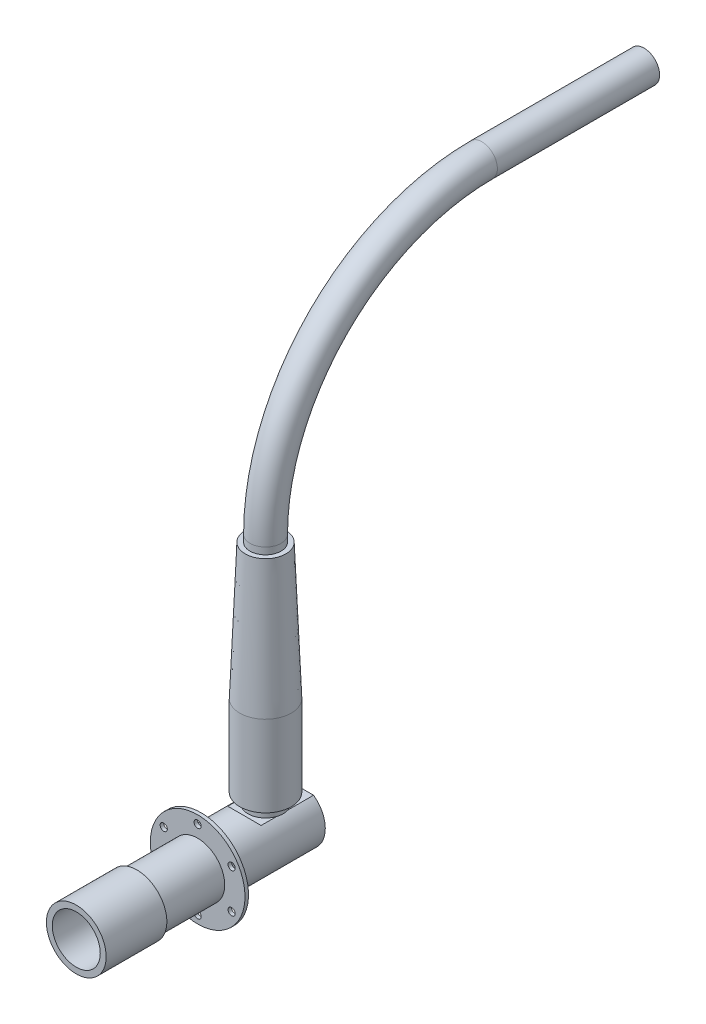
ISO-10303-21;
HEADER;
FILE_DESCRIPTION(('STEP AP214'),'2;1');
FILE_NAME('part.step','',(''),(''),'','','');
FILE_SCHEMA(('AUTOMOTIVE_DESIGN { 1 0 10303 214 1 1 1 1 }'));
ENDSEC;
DATA;
#1=APPLICATION_CONTEXT('core data for automotive mechanical design processes');
#2=APPLICATION_PROTOCOL_DEFINITION('international standard','automotive_design',2000,#1);
#3=PRODUCT_CONTEXT('',#1,'mechanical');
#4=PRODUCT('Part','Part','',(#3));
#5=PRODUCT_RELATED_PRODUCT_CATEGORY('part','',(#4));
#6=PRODUCT_DEFINITION_FORMATION('','',#4);
#7=PRODUCT_DEFINITION_CONTEXT('part definition',#1,'design');
#8=PRODUCT_DEFINITION('design','',#6,#7);
#9=PRODUCT_DEFINITION_SHAPE('','',#8);
#10=(LENGTH_UNIT() NAMED_UNIT(*) SI_UNIT(.MILLI.,.METRE.));
#11=(NAMED_UNIT(*) PLANE_ANGLE_UNIT() SI_UNIT($,.RADIAN.));
#12=(NAMED_UNIT(*) SI_UNIT($,.STERADIAN.) SOLID_ANGLE_UNIT());
#13=UNCERTAINTY_MEASURE_WITH_UNIT(LENGTH_MEASURE(1.E-05),#10,'distance_accuracy_value','');
#14=(GEOMETRIC_REPRESENTATION_CONTEXT(3) GLOBAL_UNCERTAINTY_ASSIGNED_CONTEXT((#13)) GLOBAL_UNIT_ASSIGNED_CONTEXT((#10,
#11,#12)) REPRESENTATION_CONTEXT('',''));
#15=CARTESIAN_POINT('',(0.,0.,0.));
#16=DIRECTION('',(0.,0.,1.));
#17=DIRECTION('',(1.,0.,0.));
#18=AXIS2_PLACEMENT_3D('',#15,#16,#17);
#19=CARTESIAN_POINT('',(-44.45,21.59,-40.64));
#20=DIRECTION('',(0.,-1.,0.));
#21=DIRECTION('',(0.,0.,-1.));
#22=AXIS2_PLACEMENT_3D('',#19,#20,#21);
#23=PLANE('',#22);
#24=DIRECTION('',(0.,0.,1.));
#25=VECTOR('',#24,1.);
#26=CARTESIAN_POINT('',(15.6576115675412,21.59,-89.916));
#27=LINE('',#26,#25);
#28=CARTESIAN_POINT('',(15.6576115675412,21.59,-55.2156558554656));
#29=VERTEX_POINT('',#28);
#30=CARTESIAN_POINT('',(15.6576115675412,21.59,-40.64));
#31=VERTEX_POINT('',#30);
#32=EDGE_CURVE('E438',#29,#31,#27,.T.);
#33=ORIENTED_EDGE('',*,*,#32,.F.);
#34=CARTESIAN_POINT('',(0.,21.59,-60.4519999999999));
#35=DIRECTION('',(0.,-1.,0.));
#36=DIRECTION('',(0.,0.,-1.));
#37=AXIS2_PLACEMENT_3D('',#34,#35,#36);
#38=CIRCLE('',#37,16.51);
#39=CARTESIAN_POINT('',(-15.6576115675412,21.59,-55.2156558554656));
#40=VERTEX_POINT('',#39);
#41=EDGE_CURVE('E389',#29,#40,#38,.T.);
#42=ORIENTED_EDGE('',*,*,#41,.T.);
#43=DIRECTION('',(0.,0.,1.));
#44=VECTOR('',#43,1.);
#45=CARTESIAN_POINT('',(-15.6576115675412,21.59,-89.916));
#46=LINE('',#45,#44);
#47=CARTESIAN_POINT('',(-15.6576115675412,21.59,-40.64));
#48=VERTEX_POINT('',#47);
#49=EDGE_CURVE('E443',#48,#40,#46,.F.);
#50=ORIENTED_EDGE('',*,*,#49,.F.);
#51=DIRECTION('',(1.,0.,0.));
#52=VECTOR('',#51,1.);
#53=CARTESIAN_POINT('',(-44.45,21.59,-40.64));
#54=LINE('',#53,#52);
#55=EDGE_CURVE('E435',#48,#31,#54,.T.);
#56=ORIENTED_EDGE('',*,*,#55,.T.);
#57=EDGE_LOOP('',(#33,#42,#50,#56));
#58=FACE_BOUND('',#57,.T.);
#59=ADVANCED_FACE('F380',(#58),#23,.F.);
#60=CARTESIAN_POINT('',(0.,0.,0.));
#61=DIRECTION('',(0.,0.,1.));
#62=DIRECTION('',(1.,0.,0.));
#63=AXIS2_PLACEMENT_3D('',#60,#61,#62);
#64=PLANE('',#63);
#65=CARTESIAN_POINT('',(31.8957156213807,-18.4150000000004,0.));
#66=DIRECTION('',(0.,0.,1.));
#67=DIRECTION('',(1.,0.,0.));
#68=AXIS2_PLACEMENT_3D('',#65,#66,#67);
#69=CIRCLE('',#68,3.3655);
#70=CARTESIAN_POINT('',(35.2612156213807,-18.4150000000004,0.));
#71=VERTEX_POINT('',#70);
#72=EDGE_CURVE('E539',#71,#71,#69,.F.);
#73=ORIENTED_EDGE('',*,*,#72,.F.);
#74=EDGE_LOOP('',(#73));
#75=FACE_BOUND('',#74,.T.);
#76=CARTESIAN_POINT('',(31.895715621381,18.4149999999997,0.));
#77=DIRECTION('',(0.,0.,1.));
#78=DIRECTION('',(1.,0.,0.));
#79=AXIS2_PLACEMENT_3D('',#76,#77,#78);
#80=CIRCLE('',#79,3.3655);
#81=CARTESIAN_POINT('',(35.261215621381,18.4149999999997,0.));
#82=VERTEX_POINT('',#81);
#83=EDGE_CURVE('E531',#82,#82,#80,.F.);
#84=ORIENTED_EDGE('',*,*,#83,.F.);
#85=EDGE_LOOP('',(#84));
#86=FACE_BOUND('',#85,.T.);
#87=CARTESIAN_POINT('',(2.57182664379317E-13,36.83,0.));
#88=DIRECTION('',(0.,0.,1.));
#89=DIRECTION('',(1.,0.,0.));
#90=AXIS2_PLACEMENT_3D('',#87,#88,#89);
#91=CIRCLE('',#90,3.3655);
#92=CARTESIAN_POINT('',(3.36550000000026,36.83,0.));
#93=VERTEX_POINT('',#92);
#94=EDGE_CURVE('E527',#93,#93,#91,.F.);
#95=ORIENTED_EDGE('',*,*,#94,.F.);
#96=EDGE_LOOP('',(#95));
#97=FACE_BOUND('',#96,.T.);
#98=CARTESIAN_POINT('',(-31.8957156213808,18.4150000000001,0.));
#99=DIRECTION('',(0.,0.,1.));
#100=DIRECTION('',(1.,0.,0.));
#101=AXIS2_PLACEMENT_3D('',#98,#99,#100);
#102=CIRCLE('',#101,3.3655);
#103=CARTESIAN_POINT('',(-28.5302156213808,18.4150000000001,0.));
#104=VERTEX_POINT('',#103);
#105=EDGE_CURVE('E521',#104,#104,#102,.F.);
#106=ORIENTED_EDGE('',*,*,#105,.F.);
#107=EDGE_LOOP('',(#106));
#108=FACE_BOUND('',#107,.T.);
#109=CARTESIAN_POINT('',(-31.8957156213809,-18.4149999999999,0.));
#110=DIRECTION('',(0.,0.,1.));
#111=DIRECTION('',(1.,0.,0.));
#112=AXIS2_PLACEMENT_3D('',#109,#110,#111);
#113=CIRCLE('',#112,3.3655);
#114=CARTESIAN_POINT('',(-28.5302156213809,-18.4149999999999,0.));
#115=VERTEX_POINT('',#114);
#116=EDGE_CURVE('E515',#115,#115,#113,.F.);
#117=ORIENTED_EDGE('',*,*,#116,.F.);
#118=EDGE_LOOP('',(#117));
#119=FACE_BOUND('',#118,.T.);
#120=CARTESIAN_POINT('',(0.,-36.83,0.));
#121=DIRECTION('',(0.,0.,1.));
#122=DIRECTION('',(1.,0.,0.));
#123=AXIS2_PLACEMENT_3D('',#120,#121,#122);
#124=CIRCLE('',#123,3.3655);
#125=CARTESIAN_POINT('',(3.3655,-36.83,0.));
#126=VERTEX_POINT('',#125);
#127=EDGE_CURVE('E509',#126,#126,#124,.F.);
#128=ORIENTED_EDGE('',*,*,#127,.F.);
#129=EDGE_LOOP('',(#128));
#130=FACE_BOUND('',#129,.T.);
#131=CARTESIAN_POINT('',(0.,0.,0.));
#132=DIRECTION('',(0.,0.,1.));
#133=DIRECTION('',(1.,0.,0.));
#134=AXIS2_PLACEMENT_3D('',#131,#132,#133);
#135=CIRCLE('',#134,44.45);
#136=CARTESIAN_POINT('',(-44.45,0.,0.));
#137=VERTEX_POINT('',#136);
#138=EDGE_CURVE('E472',#137,#137,#135,.T.);
#139=ORIENTED_EDGE('',*,*,#138,.F.);
#140=EDGE_LOOP('',(#139));
#141=FACE_BOUND('',#140,.T.);
#142=CARTESIAN_POINT('',(0.,0.,0.));
#143=DIRECTION('',(0.,0.,1.));
#144=DIRECTION('',(1.,0.,0.));
#145=AXIS2_PLACEMENT_3D('',#142,#143,#144);
#146=CIRCLE('',#145,26.67);
#147=CARTESIAN_POINT('',(26.67,0.,0.));
#148=VERTEX_POINT('',#147);
#149=EDGE_CURVE('E478',#148,#148,#146,.F.);
#150=ORIENTED_EDGE('',*,*,#149,.F.);
#151=EDGE_LOOP('',(#150));
#152=FACE_BOUND('',#151,.T.);
#153=ADVANCED_FACE('F585',(#75,#86,#97,#108,#119,#130,#141,#152),#64,.F.);
#154=CARTESIAN_POINT('',(0.,0.,3.302));
#155=DIRECTION('',(0.,0.,1.));
#156=DIRECTION('',(1.,0.,0.));
#157=AXIS2_PLACEMENT_3D('',#154,#155,#156);
#158=PLANE('',#157);
#159=CARTESIAN_POINT('',(31.8957156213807,-18.4150000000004,3.302));
#160=DIRECTION('',(0.,0.,1.));
#161=DIRECTION('',(0.50000000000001,0.866025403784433,0.));
#162=AXIS2_PLACEMENT_3D('',#159,#160,#161);
#163=CIRCLE('',#162,3.3655);
#164=CARTESIAN_POINT('',(35.2612156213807,-18.4150000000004,3.30200000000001));
#165=VERTEX_POINT('',#164);
#166=EDGE_CURVE('E542',#165,#165,#163,.T.);
#167=ORIENTED_EDGE('',*,*,#166,.F.);
#168=EDGE_LOOP('',(#167));
#169=FACE_BOUND('',#168,.T.);
#170=CARTESIAN_POINT('',(31.895715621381,18.4149999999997,3.302));
#171=DIRECTION('',(0.,0.,1.));
#172=DIRECTION('',(-0.499999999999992,0.866025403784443,0.));
#173=AXIS2_PLACEMENT_3D('',#170,#171,#172);
#174=CIRCLE('',#173,3.3655);
#175=CARTESIAN_POINT('',(35.261215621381,18.4149999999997,3.30200000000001));
#176=VERTEX_POINT('',#175);
#177=EDGE_CURVE('E536',#176,#176,#174,.T.);
#178=ORIENTED_EDGE('',*,*,#177,.F.);
#179=EDGE_LOOP('',(#178));
#180=FACE_BOUND('',#179,.T.);
#181=CARTESIAN_POINT('',(2.57182664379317E-13,36.83,3.302));
#182=DIRECTION('',(0.,0.,1.));
#183=DIRECTION('',(-1.,0.,0.));
#184=AXIS2_PLACEMENT_3D('',#181,#182,#183);
#185=CIRCLE('',#184,3.3655);
#186=CARTESIAN_POINT('',(3.36550000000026,36.83,3.30200000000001));
#187=VERTEX_POINT('',#186);
#188=EDGE_CURVE('E528',#187,#187,#185,.T.);
#189=ORIENTED_EDGE('',*,*,#188,.F.);
#190=EDGE_LOOP('',(#189));
#191=FACE_BOUND('',#190,.T.);
#192=CARTESIAN_POINT('',(-31.8957156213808,18.4150000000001,3.302));
#193=DIRECTION('',(0.,0.,1.));
#194=DIRECTION('',(-0.500000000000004,-0.866025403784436,0.));
#195=AXIS2_PLACEMENT_3D('',#192,#193,#194);
#196=CIRCLE('',#195,3.3655);
#197=CARTESIAN_POINT('',(-28.5302156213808,18.4150000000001,3.30200000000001));
#198=VERTEX_POINT('',#197);
#199=EDGE_CURVE('E524',#198,#198,#196,.T.);
#200=ORIENTED_EDGE('',*,*,#199,.F.);
#201=EDGE_LOOP('',(#200));
#202=FACE_BOUND('',#201,.T.);
#203=CARTESIAN_POINT('',(-31.8957156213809,-18.4149999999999,3.302));
#204=DIRECTION('',(0.,0.,1.));
#205=DIRECTION('',(0.499999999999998,-0.86602540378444,0.));
#206=AXIS2_PLACEMENT_3D('',#203,#204,#205);
#207=CIRCLE('',#206,3.3655);
#208=CARTESIAN_POINT('',(-28.5302156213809,-18.4149999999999,3.30200000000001));
#209=VERTEX_POINT('',#208);
#210=EDGE_CURVE('E518',#209,#209,#207,.T.);
#211=ORIENTED_EDGE('',*,*,#210,.F.);
#212=EDGE_LOOP('',(#211));
#213=FACE_BOUND('',#212,.T.);
#214=CARTESIAN_POINT('',(0.,-36.83,3.302));
#215=DIRECTION('',(0.,0.,1.));
#216=DIRECTION('',(1.,0.,0.));
#217=AXIS2_PLACEMENT_3D('',#214,#215,#216);
#218=CIRCLE('',#217,3.3655);
#219=CARTESIAN_POINT('',(3.3655,-36.83,3.30200000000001));
#220=VERTEX_POINT('',#219);
#221=EDGE_CURVE('E512',#220,#220,#218,.T.);
#222=ORIENTED_EDGE('',*,*,#221,.F.);
#223=EDGE_LOOP('',(#222));
#224=FACE_BOUND('',#223,.T.);
#225=CARTESIAN_POINT('',(0.,0.,3.302));
#226=DIRECTION('',(0.,0.,1.));
#227=DIRECTION('',(1.,0.,0.));
#228=AXIS2_PLACEMENT_3D('',#225,#226,#227);
#229=CIRCLE('',#228,44.45);
#230=CARTESIAN_POINT('',(-44.45,0.,3.302));
#231=VERTEX_POINT('',#230);
#232=EDGE_CURVE('E475',#231,#231,#229,.T.);
#233=ORIENTED_EDGE('',*,*,#232,.T.);
#234=EDGE_LOOP('',(#233));
#235=FACE_BOUND('',#234,.T.);
#236=CARTESIAN_POINT('',(0.,0.,3.302));
#237=DIRECTION('',(0.,0.,1.));
#238=DIRECTION('',(1.,0.,0.));
#239=AXIS2_PLACEMENT_3D('',#236,#237,#238);
#240=CIRCLE('',#239,25.4);
#241=CARTESIAN_POINT('',(-25.4,0.,3.30200000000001));
#242=VERTEX_POINT('',#241);
#243=EDGE_CURVE('E466',#242,#242,#240,.T.);
#244=ORIENTED_EDGE('',*,*,#243,.F.);
#245=EDGE_LOOP('',(#244));
#246=FACE_BOUND('',#245,.T.);
#247=ADVANCED_FACE('F592',(#169,#180,#191,#202,#213,#224,#235,#246),#158,.T.);
#248=CARTESIAN_POINT('',(0.,0.,3.302));
#249=DIRECTION('',(0.,0.,-1.));
#250=DIRECTION('',(-1.,0.,0.));
#251=AXIS2_PLACEMENT_3D('',#248,#249,#250);
#252=CYLINDRICAL_SURFACE('',#251,44.45);
#253=CARTESIAN_POINT('',(-44.45,0.,3.302));
#254=CARTESIAN_POINT('',(-44.45,0.,3.26760416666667));
#255=CARTESIAN_POINT('',(-44.45,0.,3.23320833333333));
#256=CARTESIAN_POINT('',(-44.45,0.,3.16441666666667));
#257=CARTESIAN_POINT('',(-44.45,0.,3.13002083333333));
#258=CARTESIAN_POINT('',(-44.45,0.,3.06122916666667));
#259=CARTESIAN_POINT('',(-44.45,0.,3.02683333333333));
#260=CARTESIAN_POINT('',(-44.45,0.,2.95804166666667));
#261=CARTESIAN_POINT('',(-44.45,0.,2.92364583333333));
#262=CARTESIAN_POINT('',(-44.45,0.,2.85485416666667));
#263=CARTESIAN_POINT('',(-44.45,0.,2.82045833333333));
#264=CARTESIAN_POINT('',(-44.45,0.,2.75166666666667));
#265=CARTESIAN_POINT('',(-44.45,0.,2.71727083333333));
#266=CARTESIAN_POINT('',(-44.45,0.,2.64847916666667));
#267=CARTESIAN_POINT('',(-44.45,0.,2.61408333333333));
#268=CARTESIAN_POINT('',(-44.45,0.,2.54529166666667));
#269=CARTESIAN_POINT('',(-44.45,0.,2.51089583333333));
#270=CARTESIAN_POINT('',(-44.45,0.,2.44210416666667));
#271=CARTESIAN_POINT('',(-44.45,0.,2.40770833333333));
#272=CARTESIAN_POINT('',(-44.45,0.,2.33891666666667));
#273=CARTESIAN_POINT('',(-44.45,0.,2.30452083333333));
#274=CARTESIAN_POINT('',(-44.45,0.,2.23572916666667));
#275=CARTESIAN_POINT('',(-44.45,0.,2.20133333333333));
#276=CARTESIAN_POINT('',(-44.45,0.,2.13254166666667));
#277=CARTESIAN_POINT('',(-44.45,0.,2.09814583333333));
#278=CARTESIAN_POINT('',(-44.45,0.,2.02935416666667));
#279=CARTESIAN_POINT('',(-44.45,0.,1.99495833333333));
#280=CARTESIAN_POINT('',(-44.45,0.,1.92616666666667));
#281=CARTESIAN_POINT('',(-44.45,0.,1.89177083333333));
#282=CARTESIAN_POINT('',(-44.45,0.,1.82297916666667));
#283=CARTESIAN_POINT('',(-44.45,0.,1.78858333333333));
#284=CARTESIAN_POINT('',(-44.45,0.,1.71979166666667));
#285=CARTESIAN_POINT('',(-44.45,0.,1.68539583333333));
#286=CARTESIAN_POINT('',(-44.45,0.,1.61660416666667));
#287=CARTESIAN_POINT('',(-44.45,0.,1.58220833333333));
#288=CARTESIAN_POINT('',(-44.45,0.,1.51341666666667));
#289=CARTESIAN_POINT('',(-44.45,0.,1.47902083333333));
#290=CARTESIAN_POINT('',(-44.45,0.,1.41022916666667));
#291=CARTESIAN_POINT('',(-44.45,0.,1.37583333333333));
#292=CARTESIAN_POINT('',(-44.45,0.,1.30704166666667));
#293=CARTESIAN_POINT('',(-44.45,0.,1.27264583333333));
#294=CARTESIAN_POINT('',(-44.45,0.,1.20385416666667));
#295=CARTESIAN_POINT('',(-44.45,0.,1.16945833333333));
#296=CARTESIAN_POINT('',(-44.45,0.,1.10066666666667));
#297=CARTESIAN_POINT('',(-44.45,0.,1.06627083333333));
#298=CARTESIAN_POINT('',(-44.45,0.,0.997479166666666));
#299=CARTESIAN_POINT('',(-44.45,0.,0.963083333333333));
#300=CARTESIAN_POINT('',(-44.45,0.,0.894291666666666));
#301=CARTESIAN_POINT('',(-44.45,0.,0.859895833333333));
#302=CARTESIAN_POINT('',(-44.45,0.,0.791104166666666));
#303=CARTESIAN_POINT('',(-44.45,0.,0.756708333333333));
#304=CARTESIAN_POINT('',(-44.45,0.,0.687916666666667));
#305=CARTESIAN_POINT('',(-44.45,0.,0.653520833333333));
#306=CARTESIAN_POINT('',(-44.45,0.,0.584729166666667));
#307=CARTESIAN_POINT('',(-44.45,0.,0.550333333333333));
#308=CARTESIAN_POINT('',(-44.45,0.,0.481541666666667));
#309=CARTESIAN_POINT('',(-44.45,0.,0.447145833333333));
#310=CARTESIAN_POINT('',(-44.45,0.,0.378354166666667));
#311=CARTESIAN_POINT('',(-44.45,0.,0.343958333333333));
#312=CARTESIAN_POINT('',(-44.45,0.,0.275166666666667));
#313=CARTESIAN_POINT('',(-44.45,0.,0.240770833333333));
#314=CARTESIAN_POINT('',(-44.45,0.,0.171979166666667));
#315=CARTESIAN_POINT('',(-44.45,0.,0.137583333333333));
#316=CARTESIAN_POINT('',(-44.45,0.,0.0687916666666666));
#317=CARTESIAN_POINT('',(-44.45,0.,0.0343958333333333));
#318=CARTESIAN_POINT('',(-44.45,0.,0.));
#319=B_SPLINE_CURVE_WITH_KNOTS('',3,(#253,#254,#255,#256,#257,#258,#259,#260,#261,#262,#263,
#264,#265,#266,#267,#268,#269,#270,#271,#272,#273,#274,#275,#276,#277,#278,#279,#280,#281,#282,
#283,#284,#285,#286,#287,#288,#289,#290,#291,#292,#293,#294,#295,#296,#297,#298,#299,#300,#301,
#302,#303,#304,#305,#306,#307,#308,#309,#310,#311,#312,#313,#314,#315,#316,#317,#318),
.UNSPECIFIED.,.F.,.F.,(4,2,2,2,2,2,2,2,2,2,2,2,2,2,2,2,2,2,2,2,2,2,2,2,2,2,2,2,2,2,2,2,4),(0.,
0.1031875,0.206375,0.3095625,0.41275,0.5159375,0.619125,0.7223125,0.8255,0.9286875,1.031875,
1.1350625,1.23825,1.3414375,1.444625,1.5478125,1.651,1.7541875,1.857375,1.9605625,2.06375,
2.1669375,2.270125,2.3733125,2.4765,2.5796875,2.682875,2.7860625,2.88925,2.9924375,3.095625,
3.1988125,3.302),.UNSPECIFIED.);
#320=EDGE_CURVE('BSEAM382',#231,#137,#319,.T.);
#321=ORIENTED_EDGE('',*,*,#232,.F.);
#322=ORIENTED_EDGE('',*,*,#138,.T.);
#323=ORIENTED_EDGE('',*,*,#320,.T.);
#324=ORIENTED_EDGE('',*,*,#320,.F.);
#325=EDGE_LOOP('',(#321,#323,#322,#324));
#326=FACE_BOUND('',#325,.T.);
#327=ADVANCED_FACE('F382',(#326),#252,.T.);
#328=CARTESIAN_POINT('',(0.,0.,60.325));
#329=DIRECTION('',(0.,0.,-1.));
#330=DIRECTION('',(-1.,0.,0.));
#331=AXIS2_PLACEMENT_3D('',#328,#329,#330);
#332=CYLINDRICAL_SURFACE('',#331,25.4);
#333=CARTESIAN_POINT('',(0.,0.,60.325));
#334=DIRECTION('',(0.,0.,1.));
#335=DIRECTION('',(1.,0.,0.));
#336=AXIS2_PLACEMENT_3D('',#333,#334,#335);
#337=CIRCLE('',#336,25.4);
#338=CARTESIAN_POINT('',(-25.4,0.,60.325));
#339=VERTEX_POINT('',#338);
#340=EDGE_CURVE('E469',#339,#339,#337,.T.);
#341=CARTESIAN_POINT('',(-25.4,0.,60.325));
#342=CARTESIAN_POINT('',(-25.4,0.,59.7310104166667));
#343=CARTESIAN_POINT('',(-25.4,0.,59.1370208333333));
#344=CARTESIAN_POINT('',(-25.4,0.,57.9490416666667));
#345=CARTESIAN_POINT('',(-25.4,0.,57.3550520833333));
#346=CARTESIAN_POINT('',(-25.4,0.,56.1670729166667));
#347=CARTESIAN_POINT('',(-25.4,0.,55.5730833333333));
#348=CARTESIAN_POINT('',(-25.4,0.,54.3851041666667));
#349=CARTESIAN_POINT('',(-25.4,0.,53.7911145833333));
#350=CARTESIAN_POINT('',(-25.4,0.,52.6031354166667));
#351=CARTESIAN_POINT('',(-25.4,0.,52.0091458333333));
#352=CARTESIAN_POINT('',(-25.4,0.,50.8211666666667));
#353=CARTESIAN_POINT('',(-25.4,0.,50.2271770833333));
#354=CARTESIAN_POINT('',(-25.4,0.,49.0391979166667));
#355=CARTESIAN_POINT('',(-25.4,0.,48.4452083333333));
#356=CARTESIAN_POINT('',(-25.4,0.,47.2572291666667));
#357=CARTESIAN_POINT('',(-25.4,0.,46.6632395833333));
#358=CARTESIAN_POINT('',(-25.4,0.,45.4752604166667));
#359=CARTESIAN_POINT('',(-25.4,0.,44.8812708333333));
#360=CARTESIAN_POINT('',(-25.4,0.,43.6932916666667));
#361=CARTESIAN_POINT('',(-25.4,0.,43.0993020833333));
#362=CARTESIAN_POINT('',(-25.4,0.,41.9113229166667));
#363=CARTESIAN_POINT('',(-25.4,0.,41.3173333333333));
#364=CARTESIAN_POINT('',(-25.4,0.,40.1293541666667));
#365=CARTESIAN_POINT('',(-25.4,0.,39.5353645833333));
#366=CARTESIAN_POINT('',(-25.4,0.,38.3473854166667));
#367=CARTESIAN_POINT('',(-25.4,0.,37.7533958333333));
#368=CARTESIAN_POINT('',(-25.4,0.,36.5654166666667));
#369=CARTESIAN_POINT('',(-25.4,0.,35.9714270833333));
#370=CARTESIAN_POINT('',(-25.4,0.,34.7834479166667));
#371=CARTESIAN_POINT('',(-25.4,0.,34.1894583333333));
#372=CARTESIAN_POINT('',(-25.4,0.,33.0014791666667));
#373=CARTESIAN_POINT('',(-25.4,0.,32.4074895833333));
#374=CARTESIAN_POINT('',(-25.4,0.,31.2195104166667));
#375=CARTESIAN_POINT('',(-25.4,0.,30.6255208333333));
#376=CARTESIAN_POINT('',(-25.4,0.,29.4375416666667));
#377=CARTESIAN_POINT('',(-25.4,0.,28.8435520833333));
#378=CARTESIAN_POINT('',(-25.4,0.,27.6555729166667));
#379=CARTESIAN_POINT('',(-25.4,0.,27.0615833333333));
#380=CARTESIAN_POINT('',(-25.4,0.,25.8736041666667));
#381=CARTESIAN_POINT('',(-25.4,0.,25.2796145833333));
#382=CARTESIAN_POINT('',(-25.4,0.,24.0916354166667));
#383=CARTESIAN_POINT('',(-25.4,0.,23.4976458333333));
#384=CARTESIAN_POINT('',(-25.4,0.,22.3096666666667));
#385=CARTESIAN_POINT('',(-25.4,0.,21.7156770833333));
#386=CARTESIAN_POINT('',(-25.4,0.,20.5276979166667));
#387=CARTESIAN_POINT('',(-25.4,0.,19.9337083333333));
#388=CARTESIAN_POINT('',(-25.4,0.,18.7457291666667));
#389=CARTESIAN_POINT('',(-25.4,0.,18.1517395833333));
#390=CARTESIAN_POINT('',(-25.4,0.,16.9637604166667));
#391=CARTESIAN_POINT('',(-25.4,0.,16.3697708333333));
#392=CARTESIAN_POINT('',(-25.4,0.,15.1817916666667));
#393=CARTESIAN_POINT('',(-25.4,0.,14.5878020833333));
#394=CARTESIAN_POINT('',(-25.4,0.,13.3998229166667));
#395=CARTESIAN_POINT('',(-25.4,0.,12.8058333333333));
#396=CARTESIAN_POINT('',(-25.4,0.,11.6178541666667));
#397=CARTESIAN_POINT('',(-25.4,0.,11.0238645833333));
#398=CARTESIAN_POINT('',(-25.4,0.,9.83588541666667));
#399=CARTESIAN_POINT('',(-25.4,0.,9.24189583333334));
#400=CARTESIAN_POINT('',(-25.4,0.,8.05391666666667));
#401=CARTESIAN_POINT('',(-25.4,0.,7.45992708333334));
#402=CARTESIAN_POINT('',(-25.4,0.,6.27194791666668));
#403=CARTESIAN_POINT('',(-25.4,0.,5.67795833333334));
#404=CARTESIAN_POINT('',(-25.4,0.,4.48997916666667));
#405=CARTESIAN_POINT('',(-25.4,0.,3.89598958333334));
#406=CARTESIAN_POINT('',(-25.4,0.,3.30200000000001));
#407=B_SPLINE_CURVE_WITH_KNOTS('',3,(#341,#342,#343,#344,#345,#346,#347,#348,#349,#350,#351,
#352,#353,#354,#355,#356,#357,#358,#359,#360,#361,#362,#363,#364,#365,#366,#367,#368,#369,#370,
#371,#372,#373,#374,#375,#376,#377,#378,#379,#380,#381,#382,#383,#384,#385,#386,#387,#388,#389,
#390,#391,#392,#393,#394,#395,#396,#397,#398,#399,#400,#401,#402,#403,#404,#405,#406),
.UNSPECIFIED.,.F.,.F.,(4,2,2,2,2,2,2,2,2,2,2,2,2,2,2,2,2,2,2,2,2,2,2,2,2,2,2,2,2,2,2,2,4),(0.,
1.78196874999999,3.5639375,5.34590625,7.127875,8.90984374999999,10.6918125,12.47378125,14.25575,
16.03771875,17.8196875,19.60165625,21.383625,23.16559375,24.9475625,26.72953125,28.5115,
30.29346875,32.0754375,33.85740625,35.639375,37.42134375,39.2033125,40.98528125,42.76725,
44.54921875,46.3311875,48.11315625,49.895125,51.67709375,53.4590625,55.24103125,57.023),.UNSPECIFIED.);
#408=EDGE_CURVE('BSEAM624',#339,#242,#407,.T.);
#409=ORIENTED_EDGE('',*,*,#340,.F.);
#410=ORIENTED_EDGE('',*,*,#243,.T.);
#411=ORIENTED_EDGE('',*,*,#408,.T.);
#412=ORIENTED_EDGE('',*,*,#408,.F.);
#413=EDGE_LOOP('',(#409,#411,#410,#412));
#414=FACE_BOUND('',#413,.T.);
#415=ADVANCED_FACE('F624',(#414),#332,.T.);
#416=CARTESIAN_POINT('',(0.,0.,60.325));
#417=DIRECTION('',(0.,0.,1.));
#418=DIRECTION('',(1.,0.,0.));
#419=AXIS2_PLACEMENT_3D('',#416,#417,#418);
#420=PLANE('',#419);
#421=CARTESIAN_POINT('',(0.,0.,60.325));
#422=DIRECTION('',(0.,0.,1.));
#423=DIRECTION('',(1.,0.,0.));
#424=AXIS2_PLACEMENT_3D('',#421,#422,#423);
#425=CIRCLE('',#424,28.067);
#426=CARTESIAN_POINT('',(-28.067,0.,60.325));
#427=VERTEX_POINT('',#426);
#428=EDGE_CURVE('E460',#427,#427,#425,.T.);
#429=ORIENTED_EDGE('',*,*,#428,.F.);
#430=EDGE_LOOP('',(#429));
#431=FACE_BOUND('',#430,.T.);
#432=ORIENTED_EDGE('',*,*,#340,.T.);
#433=EDGE_LOOP('',(#432));
#434=FACE_BOUND('',#433,.T.);
#435=ADVANCED_FACE('F620',(#431,#434),#420,.F.);
#436=CARTESIAN_POINT('',(0.,0.,117.348));
#437=DIRECTION('',(0.,0.,-1.));
#438=DIRECTION('',(-1.,0.,0.));
#439=AXIS2_PLACEMENT_3D('',#436,#437,#438);
#440=CYLINDRICAL_SURFACE('',#439,28.067);
#441=CARTESIAN_POINT('',(0.,0.,117.348));
#442=DIRECTION('',(0.,0.,1.));
#443=DIRECTION('',(1.,0.,0.));
#444=AXIS2_PLACEMENT_3D('',#441,#442,#443);
#445=CIRCLE('',#444,28.067);
#446=CARTESIAN_POINT('',(-28.067,0.,117.348));
#447=VERTEX_POINT('',#446);
#448=EDGE_CURVE('E463',#447,#447,#445,.T.);
#449=CARTESIAN_POINT('',(-28.067,0.,117.348));
#450=CARTESIAN_POINT('',(-28.067,0.,116.754010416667));
#451=CARTESIAN_POINT('',(-28.067,0.,116.160020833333));
#452=CARTESIAN_POINT('',(-28.067,0.,114.972041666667));
#453=CARTESIAN_POINT('',(-28.067,0.,114.378052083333));
#454=CARTESIAN_POINT('',(-28.067,0.,113.190072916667));
#455=CARTESIAN_POINT('',(-28.067,0.,112.596083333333));
#456=CARTESIAN_POINT('',(-28.067,0.,111.408104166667));
#457=CARTESIAN_POINT('',(-28.067,0.,110.814114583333));
#458=CARTESIAN_POINT('',(-28.067,0.,109.626135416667));
#459=CARTESIAN_POINT('',(-28.067,0.,109.032145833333));
#460=CARTESIAN_POINT('',(-28.067,0.,107.844166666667));
#461=CARTESIAN_POINT('',(-28.067,0.,107.250177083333));
#462=CARTESIAN_POINT('',(-28.067,0.,106.062197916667));
#463=CARTESIAN_POINT('',(-28.067,0.,105.468208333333));
#464=CARTESIAN_POINT('',(-28.067,0.,104.280229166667));
#465=CARTESIAN_POINT('',(-28.067,0.,103.686239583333));
#466=CARTESIAN_POINT('',(-28.067,0.,102.498260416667));
#467=CARTESIAN_POINT('',(-28.067,0.,101.904270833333));
#468=CARTESIAN_POINT('',(-28.067,0.,100.716291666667));
#469=CARTESIAN_POINT('',(-28.067,0.,100.122302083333));
#470=CARTESIAN_POINT('',(-28.067,0.,98.9343229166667));
#471=CARTESIAN_POINT('',(-28.067,0.,98.3403333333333));
#472=CARTESIAN_POINT('',(-28.067,0.,97.1523541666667));
#473=CARTESIAN_POINT('',(-28.067,0.,96.5583645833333));
#474=CARTESIAN_POINT('',(-28.067,0.,95.3703854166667));
#475=CARTESIAN_POINT('',(-28.067,0.,94.7763958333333));
#476=CARTESIAN_POINT('',(-28.067,0.,93.5884166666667));
#477=CARTESIAN_POINT('',(-28.067,0.,92.9944270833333));
#478=CARTESIAN_POINT('',(-28.067,0.,91.8064479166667));
#479=CARTESIAN_POINT('',(-28.067,0.,91.2124583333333));
#480=CARTESIAN_POINT('',(-28.067,0.,90.0244791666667));
#481=CARTESIAN_POINT('',(-28.067,0.,89.4304895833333));
#482=CARTESIAN_POINT('',(-28.067,0.,88.2425104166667));
#483=CARTESIAN_POINT('',(-28.067,0.,87.6485208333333));
#484=CARTESIAN_POINT('',(-28.067,0.,86.4605416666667));
#485=CARTESIAN_POINT('',(-28.067,0.,85.8665520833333));
#486=CARTESIAN_POINT('',(-28.067,0.,84.6785729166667));
#487=CARTESIAN_POINT('',(-28.067,0.,84.0845833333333));
#488=CARTESIAN_POINT('',(-28.067,0.,82.8966041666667));
#489=CARTESIAN_POINT('',(-28.067,0.,82.3026145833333));
#490=CARTESIAN_POINT('',(-28.067,0.,81.1146354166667));
#491=CARTESIAN_POINT('',(-28.067,0.,80.5206458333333));
#492=CARTESIAN_POINT('',(-28.067,0.,79.3326666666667));
#493=CARTESIAN_POINT('',(-28.067,0.,78.7386770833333));
#494=CARTESIAN_POINT('',(-28.067,0.,77.5506979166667));
#495=CARTESIAN_POINT('',(-28.067,0.,76.9567083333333));
#496=CARTESIAN_POINT('',(-28.067,0.,75.7687291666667));
#497=CARTESIAN_POINT('',(-28.067,0.,75.1747395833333));
#498=CARTESIAN_POINT('',(-28.067,0.,73.9867604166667));
#499=CARTESIAN_POINT('',(-28.067,0.,73.3927708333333));
#500=CARTESIAN_POINT('',(-28.067,0.,72.2047916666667));
#501=CARTESIAN_POINT('',(-28.067,0.,71.6108020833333));
#502=CARTESIAN_POINT('',(-28.067,0.,70.4228229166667));
#503=CARTESIAN_POINT('',(-28.067,0.,69.8288333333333));
#504=CARTESIAN_POINT('',(-28.067,0.,68.6408541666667));
#505=CARTESIAN_POINT('',(-28.067,0.,68.0468645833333));
#506=CARTESIAN_POINT('',(-28.067,0.,66.8588854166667));
#507=CARTESIAN_POINT('',(-28.067,0.,66.2648958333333));
#508=CARTESIAN_POINT('',(-28.067,0.,65.0769166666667));
#509=CARTESIAN_POINT('',(-28.067,0.,64.4829270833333));
#510=CARTESIAN_POINT('',(-28.067,0.,63.2949479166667));
#511=CARTESIAN_POINT('',(-28.067,0.,62.7009583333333));
#512=CARTESIAN_POINT('',(-28.067,0.,61.5129791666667));
#513=CARTESIAN_POINT('',(-28.067,0.,60.9189895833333));
#514=CARTESIAN_POINT('',(-28.067,0.,60.325));
#515=B_SPLINE_CURVE_WITH_KNOTS('',3,(#449,#450,#451,#452,#453,#454,#455,#456,#457,#458,#459,
#460,#461,#462,#463,#464,#465,#466,#467,#468,#469,#470,#471,#472,#473,#474,#475,#476,#477,#478,
#479,#480,#481,#482,#483,#484,#485,#486,#487,#488,#489,#490,#491,#492,#493,#494,#495,#496,#497,
#498,#499,#500,#501,#502,#503,#504,#505,#506,#507,#508,#509,#510,#511,#512,#513,#514),
.UNSPECIFIED.,.F.,.F.,(4,2,2,2,2,2,2,2,2,2,2,2,2,2,2,2,2,2,2,2,2,2,2,2,2,2,2,2,2,2,2,2,4),(0.,
1.78196875,3.5639375,5.34590625,7.12787500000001,8.90984375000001,10.6918125,12.47378125,
14.25575,16.03771875,17.8196875,19.60165625,21.383625,23.16559375,24.9475625,26.72953125,
28.5115,30.29346875,32.0754375,33.85740625,35.639375,37.42134375,39.2033125,40.98528125,
42.76725,44.54921875,46.3311875,48.11315625,49.895125,51.67709375,53.4590625,55.24103125,
57.023),.UNSPECIFIED.);
#516=EDGE_CURVE('BSEAM623',#447,#427,#515,.T.);
#517=ORIENTED_EDGE('',*,*,#448,.F.);
#518=ORIENTED_EDGE('',*,*,#428,.T.);
#519=ORIENTED_EDGE('',*,*,#516,.T.);
#520=ORIENTED_EDGE('',*,*,#516,.F.);
#521=EDGE_LOOP('',(#517,#519,#518,#520));
#522=FACE_BOUND('',#521,.T.);
#523=ADVANCED_FACE('F623',(#522),#440,.T.);
#524=CARTESIAN_POINT('',(0.,0.,117.348));
#525=DIRECTION('',(0.,0.,1.));
#526=DIRECTION('',(1.,0.,0.));
#527=AXIS2_PLACEMENT_3D('',#524,#525,#526);
#528=PLANE('',#527);
#529=CARTESIAN_POINT('',(0.,0.,117.348));
#530=DIRECTION('',(0.,0.,1.));
#531=DIRECTION('',(1.,0.,0.));
#532=AXIS2_PLACEMENT_3D('',#529,#530,#531);
#533=CIRCLE('',#532,22.5425);
#534=CARTESIAN_POINT('',(22.5425,0.,117.348));
#535=VERTEX_POINT('',#534);
#536=EDGE_CURVE('E454',#535,#535,#533,.T.);
#537=ORIENTED_EDGE('',*,*,#536,.F.);
#538=EDGE_LOOP('',(#537));
#539=FACE_BOUND('',#538,.T.);
#540=ORIENTED_EDGE('',*,*,#448,.T.);
#541=EDGE_LOOP('',(#540));
#542=FACE_BOUND('',#541,.T.);
#543=ADVANCED_FACE('F618',(#539,#542),#528,.T.);
#544=CARTESIAN_POINT('',(0.,0.,64.008));
#545=DIRECTION('',(0.,0.,1.));
#546=DIRECTION('',(1.,0.,0.));
#547=AXIS2_PLACEMENT_3D('',#544,#545,#546);
#548=CYLINDRICAL_SURFACE('',#547,22.5425);
#549=CARTESIAN_POINT('',(0.,0.,64.008));
#550=DIRECTION('',(0.,0.,1.));
#551=DIRECTION('',(1.,0.,0.));
#552=AXIS2_PLACEMENT_3D('',#549,#550,#551);
#553=CIRCLE('',#552,22.5425);
#554=CARTESIAN_POINT('',(22.5425,0.,64.008));
#555=VERTEX_POINT('',#554);
#556=EDGE_CURVE('E457',#555,#555,#553,.T.);
#557=ORIENTED_EDGE('',*,*,#556,.F.);
#558=EDGE_LOOP('',(#557));
#559=FACE_BOUND('',#558,.T.);
#560=ORIENTED_EDGE('',*,*,#536,.T.);
#561=EDGE_LOOP('',(#560));
#562=FACE_BOUND('',#561,.T.);
#563=ADVANCED_FACE('F614',(#559,#562),#548,.F.);
#564=CARTESIAN_POINT('',(0.,0.,64.008));
#565=DIRECTION('',(0.,0.,1.));
#566=DIRECTION('',(1.,0.,0.));
#567=AXIS2_PLACEMENT_3D('',#564,#565,#566);
#568=PLANE('',#567);
#569=ORIENTED_EDGE('',*,*,#556,.T.);
#570=EDGE_LOOP('',(#569));
#571=FACE_BOUND('',#570,.T.);
#572=ADVANCED_FACE('F611',(#571),#568,.T.);
#573=CARTESIAN_POINT('',(0.,0.,-89.916));
#574=DIRECTION('',(0.,0.,1.));
#575=DIRECTION('',(1.,0.,0.));
#576=AXIS2_PLACEMENT_3D('',#573,#574,#575);
#577=CYLINDRICAL_SURFACE('',#576,26.67);
#578=CARTESIAN_POINT('',(0.,0.,-89.916));
#579=DIRECTION('',(0.,0.,-1.));
#580=DIRECTION('',(-1.,0.,0.));
#581=AXIS2_PLACEMENT_3D('',#578,#579,#580);
#582=CIRCLE('',#581,26.67);
#583=CARTESIAN_POINT('',(15.6576115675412,21.59,-89.916));
#584=VERTEX_POINT('',#583);
#585=CARTESIAN_POINT('',(-15.6576115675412,21.59,-89.916));
#586=VERTEX_POINT('',#585);
#587=EDGE_CURVE('E448',#584,#586,#582,.T.);
#588=ORIENTED_EDGE('',*,*,#587,.F.);
#589=CARTESIAN_POINT('',(15.6576115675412,21.59,-65.6883441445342));
#590=VERTEX_POINT('',#589);
#591=EDGE_CURVE('E405',#584,#590,#27,.T.);
#592=ORIENTED_EDGE('',*,*,#591,.T.);
#593=EDGE_CURVE('E434',#590,#29,#27,.T.);
#594=ORIENTED_EDGE('',*,*,#593,.T.);
#595=ORIENTED_EDGE('',*,*,#32,.T.);
#596=CARTESIAN_POINT('',(0.,0.,-62.23));
#597=DIRECTION('',(0.,-0.707106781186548,0.707106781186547));
#598=DIRECTION('',(0.,0.707106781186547,0.707106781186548));
#599=AXIS2_PLACEMENT_3D('',#596,#597,#598);
#600=ELLIPSE('',#599,37.7170757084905,26.67);
#601=EDGE_CURVE('E482',#31,#48,#600,.T.);
#602=ORIENTED_EDGE('',*,*,#601,.T.);
#603=ORIENTED_EDGE('',*,*,#49,.T.);
#604=CARTESIAN_POINT('',(-15.6576115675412,21.59,-65.6883441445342));
#605=VERTEX_POINT('',#604);
#606=EDGE_CURVE('E487',#40,#605,#46,.F.);
#607=ORIENTED_EDGE('',*,*,#606,.T.);
#608=EDGE_CURVE('E485',#605,#586,#46,.F.);
#609=ORIENTED_EDGE('',*,*,#608,.T.);
#610=EDGE_LOOP('',(#588,#592,#594,#595,#602,#603,#607,#609));
#611=FACE_BOUND('',#610,.T.);
#612=ORIENTED_EDGE('',*,*,#149,.T.);
#613=EDGE_LOOP('',(#612));
#614=FACE_BOUND('',#613,.T.);
#615=ADVANCED_FACE('F446',(#611,#614),#577,.T.);
#616=CARTESIAN_POINT('',(0.,0.,-89.916));
#617=DIRECTION('',(0.,0.,-1.));
#618=DIRECTION('',(-1.,0.,0.));
#619=AXIS2_PLACEMENT_3D('',#616,#617,#618);
#620=PLANE('',#619);
#621=DIRECTION('',(-1.,0.,0.));
#622=VECTOR('',#621,1.);
#623=CARTESIAN_POINT('',(0.,21.59,-89.916));
#624=LINE('',#623,#622);
#625=EDGE_CURVE('E481',#584,#586,#624,.T.);
#626=ORIENTED_EDGE('',*,*,#625,.F.);
#627=ORIENTED_EDGE('',*,*,#587,.T.);
#628=EDGE_LOOP('',(#626,#627));
#629=FACE_BOUND('',#628,.T.);
#630=ADVANCED_FACE('F602',(#629),#620,.T.);
#631=CARTESIAN_POINT('',(-44.45,21.59,-40.64));
#632=DIRECTION('',(0.,-0.707106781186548,0.707106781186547));
#633=DIRECTION('',(0.,-0.707106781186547,-0.707106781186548));
#634=AXIS2_PLACEMENT_3D('',#631,#632,#633);
#635=PLANE('',#634);
#636=ORIENTED_EDGE('',*,*,#55,.F.);
#637=ORIENTED_EDGE('',*,*,#601,.F.);
#638=EDGE_LOOP('',(#636,#637));
#639=FACE_BOUND('',#638,.T.);
#640=ADVANCED_FACE('F598',(#639),#635,.F.);
#641=ORIENTED_EDGE('',*,*,#608,.F.);
#642=EDGE_CURVE('E384',#605,#590,#38,.T.);
#643=ORIENTED_EDGE('',*,*,#642,.T.);
#644=ORIENTED_EDGE('',*,*,#591,.F.);
#645=ORIENTED_EDGE('',*,*,#625,.T.);
#646=EDGE_LOOP('',(#641,#643,#644,#645));
#647=FACE_BOUND('',#646,.T.);
#648=ADVANCED_FACE('F484',(#647),#23,.F.);
#649=CARTESIAN_POINT('',(0.,21.59,-60.452));
#650=DIRECTION('',(0.,-1.,0.));
#651=DIRECTION('',(0.,0.,-1.));
#652=AXIS2_PLACEMENT_3D('',#649,#650,#651);
#653=PLANE('',#652);
#654=ORIENTED_EDGE('',*,*,#593,.F.);
#655=CARTESIAN_POINT('',(0.,21.59,-60.4519999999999));
#656=DIRECTION('',(0.,1.,0.));
#657=DIRECTION('',(0.,0.,1.));
#658=AXIS2_PLACEMENT_3D('',#655,#656,#657);
#659=CIRCLE('',#658,16.51);
#660=EDGE_CURVE('E397',#29,#590,#659,.T.);
#661=ORIENTED_EDGE('',*,*,#660,.F.);
#662=EDGE_LOOP('',(#654,#661));
#663=FACE_BOUND('',#662,.T.);
#664=ADVANCED_FACE('F432',(#663),#653,.T.);
#665=ORIENTED_EDGE('',*,*,#606,.F.);
#666=EDGE_CURVE('E427',#605,#40,#659,.T.);
#667=ORIENTED_EDGE('',*,*,#666,.F.);
#668=EDGE_LOOP('',(#665,#667));
#669=FACE_BOUND('',#668,.T.);
#670=ADVANCED_FACE('F489',(#669),#653,.T.);
#671=CARTESIAN_POINT('',(0.,254.051322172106,-60.4519999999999));
#672=DIRECTION('',(0.,1.,0.));
#673=DIRECTION('',(0.,0.,1.));
#674=AXIS2_PLACEMENT_3D('',#671,#672,#673);
#675=CYLINDRICAL_SURFACE('',#674,16.51);
#676=ORIENTED_EDGE('',*,*,#660,.T.);
#677=ORIENTED_EDGE('',*,*,#642,.F.);
#678=ORIENTED_EDGE('',*,*,#666,.T.);
#679=ORIENTED_EDGE('',*,*,#41,.F.);
#680=EDGE_LOOP('',(#676,#677,#678,#679));
#681=FACE_BOUND('',#680,.T.);
#682=CARTESIAN_POINT('',(0.,27.94,-60.4519999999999));
#683=DIRECTION('',(0.,1.,0.));
#684=DIRECTION('',(0.,0.,1.));
#685=AXIS2_PLACEMENT_3D('',#682,#683,#684);
#686=CIRCLE('',#685,16.51);
#687=CARTESIAN_POINT('',(0.,27.94,-43.942));
#688=VERTEX_POINT('',#687);
#689=EDGE_CURVE('E490',#688,#688,#686,.T.);
#690=ORIENTED_EDGE('',*,*,#689,.F.);
#691=EDGE_LOOP('',(#690));
#692=FACE_BOUND('',#691,.T.);
#693=ADVANCED_FACE('F425',(#681,#692),#675,.T.);
#694=CARTESIAN_POINT('',(0.,27.94,-43.942));
#695=DIRECTION('',(0.,-1.,0.));
#696=DIRECTION('',(0.,0.,-1.));
#697=AXIS2_PLACEMENT_3D('',#694,#695,#696);
#698=PLANE('',#697);
#699=ORIENTED_EDGE('',*,*,#689,.T.);
#700=EDGE_LOOP('',(#699));
#701=FACE_BOUND('',#700,.T.);
#702=CARTESIAN_POINT('',(0.,27.94,-60.4519999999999));
#703=DIRECTION('',(0.,1.,0.));
#704=DIRECTION('',(0.,0.,1.));
#705=AXIS2_PLACEMENT_3D('',#702,#703,#704);
#706=CIRCLE('',#705,17.4625);
#707=CARTESIAN_POINT('',(0.,27.94,-42.9895));
#708=VERTEX_POINT('',#707);
#709=EDGE_CURVE('E492',#708,#708,#706,.T.);
#710=ORIENTED_EDGE('',*,*,#709,.F.);
#711=EDGE_LOOP('',(#710));
#712=FACE_BOUND('',#711,.T.);
#713=ADVANCED_FACE('F760',(#701,#712),#698,.T.);
#714=CARTESIAN_POINT('',(0.,254.051322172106,-60.4519999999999));
#715=DIRECTION('',(0.,1.,0.));
#716=DIRECTION('',(0.,0.,1.));
#717=AXIS2_PLACEMENT_3D('',#714,#715,#716);
#718=CYLINDRICAL_SURFACE('',#717,17.4625);
#719=ORIENTED_EDGE('',*,*,#709,.T.);
#720=EDGE_LOOP('',(#719));
#721=FACE_BOUND('',#720,.T.);
#722=CARTESIAN_POINT('',(0.,31.115,-60.4519999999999));
#723=DIRECTION('',(0.,1.,0.));
#724=DIRECTION('',(0.,0.,1.));
#725=AXIS2_PLACEMENT_3D('',#722,#723,#724);
#726=CIRCLE('',#725,17.4625);
#727=CARTESIAN_POINT('',(0.,31.115,-42.9895));
#728=VERTEX_POINT('',#727);
#729=EDGE_CURVE('E497',#728,#728,#726,.T.);
#730=ORIENTED_EDGE('',*,*,#729,.F.);
#731=EDGE_LOOP('',(#730));
#732=FACE_BOUND('',#731,.T.);
#733=ADVANCED_FACE('F752',(#721,#732),#718,.T.);
#734=CARTESIAN_POINT('',(0.,31.115,-42.9895));
#735=DIRECTION('',(0.,-1.,0.));
#736=DIRECTION('',(0.,0.,-1.));
#737=AXIS2_PLACEMENT_3D('',#734,#735,#736);
#738=PLANE('',#737);
#739=ORIENTED_EDGE('',*,*,#729,.T.);
#740=EDGE_LOOP('',(#739));
#741=FACE_BOUND('',#740,.T.);
#742=CARTESIAN_POINT('',(0.,31.115,-60.4519999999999));
#743=DIRECTION('',(0.,1.,0.));
#744=DIRECTION('',(0.,0.,1.));
#745=AXIS2_PLACEMENT_3D('',#742,#743,#744);
#746=CIRCLE('',#745,24.13);
#747=CARTESIAN_POINT('',(0.,31.115,-36.322));
#748=VERTEX_POINT('',#747);
#749=EDGE_CURVE('E500',#748,#748,#746,.T.);
#750=ORIENTED_EDGE('',*,*,#749,.F.);
#751=EDGE_LOOP('',(#750));
#752=FACE_BOUND('',#751,.T.);
#753=ADVANCED_FACE('F581',(#741,#752),#738,.T.);
#754=CARTESIAN_POINT('',(0.,254.051322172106,-60.4519999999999));
#755=DIRECTION('',(0.,1.,0.));
#756=DIRECTION('',(0.,0.,1.));
#757=AXIS2_PLACEMENT_3D('',#754,#755,#756);
#758=CYLINDRICAL_SURFACE('',#757,24.13);
#759=ORIENTED_EDGE('',*,*,#749,.T.);
#760=EDGE_LOOP('',(#759));
#761=FACE_BOUND('',#760,.T.);
#762=CARTESIAN_POINT('',(0.,107.315,-60.4519999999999));
#763=DIRECTION('',(0.,1.,0.));
#764=DIRECTION('',(0.,0.,1.));
#765=AXIS2_PLACEMENT_3D('',#762,#763,#764);
#766=CIRCLE('',#765,24.13);
#767=CARTESIAN_POINT('',(0.,107.315,-36.322));
#768=VERTEX_POINT('',#767);
#769=EDGE_CURVE('E503',#768,#768,#766,.T.);
#770=ORIENTED_EDGE('',*,*,#769,.F.);
#771=EDGE_LOOP('',(#770));
#772=FACE_BOUND('',#771,.T.);
#773=ADVANCED_FACE('F574',(#761,#772),#758,.T.);
#774=CARTESIAN_POINT('',(0.,234.329358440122,-60.4519999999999));
#775=DIRECTION('',(0.,-1.,0.));
#776=DIRECTION('',(0.,0.,-1.));
#777=AXIS2_PLACEMENT_3D('',#774,#775,#776);
#778=CONICAL_SURFACE('',#777,19.05,0.0399741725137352);
#779=ORIENTED_EDGE('',*,*,#769,.T.);
#780=EDGE_LOOP('',(#779));
#781=FACE_BOUND('',#780,.T.);
#782=CARTESIAN_POINT('',(0.,234.329358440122,-60.4519999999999));
#783=DIRECTION('',(0.,1.,0.));
#784=DIRECTION('',(0.,0.,1.));
#785=AXIS2_PLACEMENT_3D('',#782,#783,#784);
#786=CIRCLE('',#785,19.05);
#787=CARTESIAN_POINT('',(0.,234.329358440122,-41.402));
#788=VERTEX_POINT('',#787);
#789=EDGE_CURVE('E506',#788,#788,#786,.T.);
#790=ORIENTED_EDGE('',*,*,#789,.F.);
#791=EDGE_LOOP('',(#790));
#792=FACE_BOUND('',#791,.T.);
#793=ADVANCED_FACE('F569',(#781,#792),#778,.T.);
#794=CARTESIAN_POINT('',(0.,234.329358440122,-60.4519999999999));
#795=DIRECTION('',(0.,1.,0.));
#796=DIRECTION('',(0.,0.,1.));
#797=AXIS2_PLACEMENT_3D('',#794,#795,#796);
#798=PLANE('',#797);
#799=CARTESIAN_POINT('',(0.,234.329358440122,-60.4519999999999));
#800=DIRECTION('',(0.,1.,0.));
#801=DIRECTION('',(0.,0.,1.));
#802=AXIS2_PLACEMENT_3D('',#799,#800,#801);
#803=CIRCLE('',#802,14.605);
#804=CARTESIAN_POINT('',(0.,234.329358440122,-45.8469999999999));
#805=VERTEX_POINT('',#804);
#806=EDGE_CURVE('E11',#805,#805,#803,.T.);
#807=ORIENTED_EDGE('',*,*,#806,.F.);
#808=EDGE_LOOP('',(#807));
#809=FACE_BOUND('',#808,.T.);
#810=ORIENTED_EDGE('',*,*,#789,.T.);
#811=EDGE_LOOP('',(#810));
#812=FACE_BOUND('',#811,.T.);
#813=ADVANCED_FACE('F565',(#809,#812),#798,.T.);
#814=CARTESIAN_POINT('',(0.,-36.83,-89.917));
#815=DIRECTION('',(0.,0.,1.));
#816=DIRECTION('',(1.,0.,0.));
#817=AXIS2_PLACEMENT_3D('',#814,#815,#816);
#818=CYLINDRICAL_SURFACE('',#817,3.3655);
#819=CARTESIAN_POINT('',(3.3655,-36.83,3.30200000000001));
#820=CARTESIAN_POINT('',(3.3655,-36.83,3.26760416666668));
#821=CARTESIAN_POINT('',(3.3655,-36.83,3.23320833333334));
#822=CARTESIAN_POINT('',(3.3655,-36.83,3.16441666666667));
#823=CARTESIAN_POINT('',(3.3655,-36.83,3.13002083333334));
#824=CARTESIAN_POINT('',(3.3655,-36.83,3.06122916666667));
#825=CARTESIAN_POINT('',(3.3655,-36.83,3.02683333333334));
#826=CARTESIAN_POINT('',(3.3655,-36.83,2.95804166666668));
#827=CARTESIAN_POINT('',(3.3655,-36.83,2.92364583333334));
#828=CARTESIAN_POINT('',(3.3655,-36.83,2.85485416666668));
#829=CARTESIAN_POINT('',(3.3655,-36.83,2.82045833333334));
#830=CARTESIAN_POINT('',(3.3655,-36.83,2.75166666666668));
#831=CARTESIAN_POINT('',(3.3655,-36.83,2.71727083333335));
#832=CARTESIAN_POINT('',(3.3655,-36.83,2.64847916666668));
#833=CARTESIAN_POINT('',(3.3655,-36.83,2.61408333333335));
#834=CARTESIAN_POINT('',(3.3655,-36.83,2.54529166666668));
#835=CARTESIAN_POINT('',(3.3655,-36.83,2.51089583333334));
#836=CARTESIAN_POINT('',(3.3655,-36.83,2.44210416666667));
#837=CARTESIAN_POINT('',(3.3655,-36.83,2.40770833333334));
#838=CARTESIAN_POINT('',(3.3655,-36.83,2.33891666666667));
#839=CARTESIAN_POINT('',(3.3655,-36.83,2.30452083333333));
#840=CARTESIAN_POINT('',(3.3655,-36.83,2.23572916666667));
#841=CARTESIAN_POINT('',(3.3655,-36.83,2.20133333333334));
#842=CARTESIAN_POINT('',(3.3655,-36.83,2.13254166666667));
#843=CARTESIAN_POINT('',(3.3655,-36.83,2.09814583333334));
#844=CARTESIAN_POINT('',(3.3655,-36.83,2.02935416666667));
#845=CARTESIAN_POINT('',(3.3655,-36.83,1.99495833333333));
#846=CARTESIAN_POINT('',(3.3655,-36.83,1.92616666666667));
#847=CARTESIAN_POINT('',(3.3655,-36.83,1.89177083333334));
#848=CARTESIAN_POINT('',(3.3655,-36.83,1.82297916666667));
#849=CARTESIAN_POINT('',(3.3655,-36.83,1.78858333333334));
#850=CARTESIAN_POINT('',(3.3655,-36.83,1.71979166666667));
#851=CARTESIAN_POINT('',(3.3655,-36.83,1.68539583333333));
#852=CARTESIAN_POINT('',(3.3655,-36.83,1.61660416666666));
#853=CARTESIAN_POINT('',(3.3655,-36.83,1.58220833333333));
#854=CARTESIAN_POINT('',(3.3655,-36.83,1.51341666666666));
#855=CARTESIAN_POINT('',(3.3655,-36.83,1.47902083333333));
#856=CARTESIAN_POINT('',(3.3655,-36.83,1.41022916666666));
#857=CARTESIAN_POINT('',(3.3655,-36.83,1.37583333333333));
#858=CARTESIAN_POINT('',(3.3655,-36.83,1.30704166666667));
#859=CARTESIAN_POINT('',(3.3655,-36.83,1.27264583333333));
#860=CARTESIAN_POINT('',(3.3655,-36.83,1.20385416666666));
#861=CARTESIAN_POINT('',(3.3655,-36.83,1.16945833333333));
#862=CARTESIAN_POINT('',(3.3655,-36.83,1.10066666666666));
#863=CARTESIAN_POINT('',(3.3655,-36.83,1.06627083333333));
#864=CARTESIAN_POINT('',(3.3655,-36.83,0.997479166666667));
#865=CARTESIAN_POINT('',(3.3655,-36.83,0.963083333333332));
#866=CARTESIAN_POINT('',(3.3655,-36.83,0.894291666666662));
#867=CARTESIAN_POINT('',(3.3655,-36.83,0.859895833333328));
#868=CARTESIAN_POINT('',(3.3655,-36.83,0.791104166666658));
#869=CARTESIAN_POINT('',(3.3655,-36.83,0.756708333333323));
#870=CARTESIAN_POINT('',(3.3655,-36.83,0.687916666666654));
#871=CARTESIAN_POINT('',(3.3655,-36.83,0.653520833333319));
#872=CARTESIAN_POINT('',(3.3655,-36.83,0.584729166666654));
#873=CARTESIAN_POINT('',(3.3655,-36.83,0.550333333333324));
#874=CARTESIAN_POINT('',(3.3655,-36.83,0.481541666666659));
#875=CARTESIAN_POINT('',(3.3655,-36.83,0.447145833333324));
#876=CARTESIAN_POINT('',(3.3655,-36.83,0.378354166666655));
#877=CARTESIAN_POINT('',(3.3655,-36.83,0.34395833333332));
#878=CARTESIAN_POINT('',(3.3655,-36.83,0.275166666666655));
#879=CARTESIAN_POINT('',(3.3655,-36.83,0.240770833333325));
#880=CARTESIAN_POINT('',(3.3655,-36.83,0.17197916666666));
#881=CARTESIAN_POINT('',(3.3655,-36.83,0.137583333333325));
#882=CARTESIAN_POINT('',(3.3655,-36.83,0.0687916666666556));
#883=CARTESIAN_POINT('',(3.3655,-36.83,0.0343958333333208));
#884=CARTESIAN_POINT('',(3.3655,-36.83,0.));
#885=B_SPLINE_CURVE_WITH_KNOTS('',3,(#819,#820,#821,#822,#823,#824,#825,#826,#827,#828,#829,
#830,#831,#832,#833,#834,#835,#836,#837,#838,#839,#840,#841,#842,#843,#844,#845,#846,#847,#848,
#849,#850,#851,#852,#853,#854,#855,#856,#857,#858,#859,#860,#861,#862,#863,#864,#865,#866,#867,
#868,#869,#870,#871,#872,#873,#874,#875,#876,#877,#878,#879,#880,#881,#882,#883,#884),
.UNSPECIFIED.,.F.,.F.,(4,2,2,2,2,2,2,2,2,2,2,2,2,2,2,2,2,2,2,2,2,2,2,2,2,2,2,2,2,2,2,2,4),(0.,
0.103187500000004,0.206375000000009,0.309562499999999,0.412750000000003,0.515937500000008,
0.619124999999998,0.722312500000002,0.825500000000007,0.928687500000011,1.03187500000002,
1.13506250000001,1.23825000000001,1.34143750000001,1.444625,1.54781250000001,1.65100000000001,
1.75418750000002,1.85737500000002,1.96056250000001,2.06375000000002,2.16693750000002,
2.27012500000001,2.37331250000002,2.47650000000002,2.57968750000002,2.68287500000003,
2.78606250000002,2.88925000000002,2.99243750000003,3.09562500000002,3.19881250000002,
3.30200000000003),.UNSPECIFIED.);
#886=EDGE_CURVE('BSEAM568',#220,#126,#885,.T.);
#887=ORIENTED_EDGE('',*,*,#221,.T.);
#888=ORIENTED_EDGE('',*,*,#127,.T.);
#889=ORIENTED_EDGE('',*,*,#886,.T.);
#890=ORIENTED_EDGE('',*,*,#886,.F.);
#891=EDGE_LOOP('',(#887,#889,#888,#890));
#892=FACE_BOUND('',#891,.T.);
#893=ADVANCED_FACE('F568',(#892),#818,.F.);
#894=CARTESIAN_POINT('',(-31.8957156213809,-18.4149999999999,-89.917));
#895=DIRECTION('',(0.,0.,1.));
#896=DIRECTION('',(1.,0.,0.));
#897=AXIS2_PLACEMENT_3D('',#894,#895,#896);
#898=CYLINDRICAL_SURFACE('',#897,3.3655);
#899=CARTESIAN_POINT('',(-28.5302156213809,-18.4149999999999,3.30200000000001));
#900=CARTESIAN_POINT('',(-28.5302156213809,-18.4149999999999,3.26760416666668));
#901=CARTESIAN_POINT('',(-28.5302156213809,-18.4149999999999,3.23320833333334));
#902=CARTESIAN_POINT('',(-28.5302156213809,-18.4149999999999,3.16441666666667));
#903=CARTESIAN_POINT('',(-28.5302156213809,-18.4149999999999,3.13002083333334));
#904=CARTESIAN_POINT('',(-28.5302156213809,-18.4149999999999,3.06122916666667));
#905=CARTESIAN_POINT('',(-28.5302156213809,-18.4149999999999,3.02683333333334));
#906=CARTESIAN_POINT('',(-28.5302156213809,-18.4149999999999,2.95804166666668));
#907=CARTESIAN_POINT('',(-28.5302156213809,-18.4149999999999,2.92364583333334));
#908=CARTESIAN_POINT('',(-28.5302156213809,-18.4149999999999,2.85485416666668));
#909=CARTESIAN_POINT('',(-28.5302156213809,-18.4149999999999,2.82045833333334));
#910=CARTESIAN_POINT('',(-28.5302156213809,-18.4149999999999,2.75166666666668));
#911=CARTESIAN_POINT('',(-28.5302156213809,-18.4149999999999,2.71727083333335));
#912=CARTESIAN_POINT('',(-28.5302156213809,-18.4149999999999,2.64847916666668));
#913=CARTESIAN_POINT('',(-28.5302156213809,-18.4149999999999,2.61408333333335));
#914=CARTESIAN_POINT('',(-28.5302156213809,-18.4149999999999,2.54529166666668));
#915=CARTESIAN_POINT('',(-28.5302156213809,-18.4149999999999,2.51089583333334));
#916=CARTESIAN_POINT('',(-28.5302156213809,-18.4149999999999,2.44210416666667));
#917=CARTESIAN_POINT('',(-28.5302156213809,-18.4149999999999,2.40770833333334));
#918=CARTESIAN_POINT('',(-28.5302156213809,-18.4149999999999,2.33891666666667));
#919=CARTESIAN_POINT('',(-28.5302156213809,-18.4149999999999,2.30452083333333));
#920=CARTESIAN_POINT('',(-28.5302156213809,-18.4149999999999,2.23572916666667));
#921=CARTESIAN_POINT('',(-28.5302156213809,-18.4149999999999,2.20133333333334));
#922=CARTESIAN_POINT('',(-28.5302156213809,-18.4149999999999,2.13254166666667));
#923=CARTESIAN_POINT('',(-28.5302156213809,-18.4149999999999,2.09814583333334));
#924=CARTESIAN_POINT('',(-28.5302156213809,-18.4149999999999,2.02935416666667));
#925=CARTESIAN_POINT('',(-28.5302156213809,-18.4149999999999,1.99495833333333));
#926=CARTESIAN_POINT('',(-28.5302156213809,-18.4149999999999,1.92616666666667));
#927=CARTESIAN_POINT('',(-28.5302156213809,-18.4149999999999,1.89177083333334));
#928=CARTESIAN_POINT('',(-28.5302156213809,-18.4149999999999,1.82297916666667));
#929=CARTESIAN_POINT('',(-28.5302156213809,-18.4149999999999,1.78858333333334));
#930=CARTESIAN_POINT('',(-28.5302156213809,-18.4149999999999,1.71979166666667));
#931=CARTESIAN_POINT('',(-28.5302156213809,-18.4149999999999,1.68539583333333));
#932=CARTESIAN_POINT('',(-28.5302156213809,-18.4149999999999,1.61660416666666));
#933=CARTESIAN_POINT('',(-28.5302156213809,-18.4149999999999,1.58220833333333));
#934=CARTESIAN_POINT('',(-28.5302156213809,-18.4149999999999,1.51341666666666));
#935=CARTESIAN_POINT('',(-28.5302156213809,-18.4149999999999,1.47902083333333));
#936=CARTESIAN_POINT('',(-28.5302156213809,-18.4149999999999,1.41022916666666));
#937=CARTESIAN_POINT('',(-28.5302156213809,-18.4149999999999,1.37583333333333));
#938=CARTESIAN_POINT('',(-28.5302156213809,-18.4149999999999,1.30704166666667));
#939=CARTESIAN_POINT('',(-28.5302156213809,-18.4149999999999,1.27264583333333));
#940=CARTESIAN_POINT('',(-28.5302156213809,-18.4149999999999,1.20385416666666));
#941=CARTESIAN_POINT('',(-28.5302156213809,-18.4149999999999,1.16945833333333));
#942=CARTESIAN_POINT('',(-28.5302156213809,-18.4149999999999,1.10066666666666));
#943=CARTESIAN_POINT('',(-28.5302156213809,-18.4149999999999,1.06627083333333));
#944=CARTESIAN_POINT('',(-28.5302156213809,-18.4149999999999,0.997479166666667));
#945=CARTESIAN_POINT('',(-28.5302156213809,-18.4149999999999,0.963083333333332));
#946=CARTESIAN_POINT('',(-28.5302156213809,-18.4149999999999,0.894291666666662));
#947=CARTESIAN_POINT('',(-28.5302156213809,-18.4149999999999,0.859895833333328));
#948=CARTESIAN_POINT('',(-28.5302156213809,-18.4149999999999,0.791104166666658));
#949=CARTESIAN_POINT('',(-28.5302156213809,-18.4149999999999,0.756708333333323));
#950=CARTESIAN_POINT('',(-28.5302156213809,-18.4149999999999,0.687916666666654));
#951=CARTESIAN_POINT('',(-28.5302156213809,-18.4149999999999,0.653520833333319));
#952=CARTESIAN_POINT('',(-28.5302156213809,-18.4149999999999,0.584729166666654));
#953=CARTESIAN_POINT('',(-28.5302156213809,-18.4149999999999,0.550333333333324));
#954=CARTESIAN_POINT('',(-28.5302156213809,-18.4149999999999,0.481541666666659));
#955=CARTESIAN_POINT('',(-28.5302156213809,-18.4149999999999,0.447145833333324));
#956=CARTESIAN_POINT('',(-28.5302156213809,-18.4149999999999,0.378354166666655));
#957=CARTESIAN_POINT('',(-28.5302156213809,-18.4149999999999,0.34395833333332));
#958=CARTESIAN_POINT('',(-28.5302156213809,-18.4149999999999,0.275166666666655));
#959=CARTESIAN_POINT('',(-28.5302156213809,-18.4149999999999,0.240770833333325));
#960=CARTESIAN_POINT('',(-28.5302156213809,-18.4149999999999,0.17197916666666));
#961=CARTESIAN_POINT('',(-28.5302156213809,-18.4149999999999,0.137583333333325));
#962=CARTESIAN_POINT('',(-28.5302156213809,-18.4149999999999,0.0687916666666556));
#963=CARTESIAN_POINT('',(-28.5302156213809,-18.4149999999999,0.0343958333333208));
#964=CARTESIAN_POINT('',(-28.5302156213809,-18.4149999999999,0.));
#965=B_SPLINE_CURVE_WITH_KNOTS('',3,(#899,#900,#901,#902,#903,#904,#905,#906,#907,#908,#909,
#910,#911,#912,#913,#914,#915,#916,#917,#918,#919,#920,#921,#922,#923,#924,#925,#926,#927,#928,
#929,#930,#931,#932,#933,#934,#935,#936,#937,#938,#939,#940,#941,#942,#943,#944,#945,#946,#947,
#948,#949,#950,#951,#952,#953,#954,#955,#956,#957,#958,#959,#960,#961,#962,#963,#964),
.UNSPECIFIED.,.F.,.F.,(4,2,2,2,2,2,2,2,2,2,2,2,2,2,2,2,2,2,2,2,2,2,2,2,2,2,2,2,2,2,2,2,4),(0.,
0.103187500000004,0.206375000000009,0.309562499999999,0.412750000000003,0.515937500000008,
0.619124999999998,0.722312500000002,0.825500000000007,0.928687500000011,1.03187500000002,
1.13506250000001,1.23825000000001,1.34143750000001,1.444625,1.54781250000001,1.65100000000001,
1.75418750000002,1.85737500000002,1.96056250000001,2.06375000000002,2.16693750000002,
2.27012500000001,2.37331250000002,2.47650000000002,2.57968750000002,2.68287500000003,
2.78606250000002,2.88925000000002,2.99243750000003,3.09562500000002,3.19881250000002,
3.30200000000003),.UNSPECIFIED.);
#966=EDGE_CURVE('BSEAM664',#209,#115,#965,.T.);
#967=ORIENTED_EDGE('',*,*,#210,.T.);
#968=ORIENTED_EDGE('',*,*,#116,.T.);
#969=ORIENTED_EDGE('',*,*,#966,.T.);
#970=ORIENTED_EDGE('',*,*,#966,.F.);
#971=EDGE_LOOP('',(#967,#969,#968,#970));
#972=FACE_BOUND('',#971,.T.);
#973=ADVANCED_FACE('F664',(#972),#898,.F.);
#974=CARTESIAN_POINT('',(-31.8957156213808,18.4150000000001,-89.917));
#975=DIRECTION('',(0.,0.,1.));
#976=DIRECTION('',(1.,0.,0.));
#977=AXIS2_PLACEMENT_3D('',#974,#975,#976);
#978=CYLINDRICAL_SURFACE('',#977,3.3655);
#979=CARTESIAN_POINT('',(-28.5302156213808,18.4150000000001,3.30200000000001));
#980=CARTESIAN_POINT('',(-28.5302156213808,18.4150000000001,3.26760416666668));
#981=CARTESIAN_POINT('',(-28.5302156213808,18.4150000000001,3.23320833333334));
#982=CARTESIAN_POINT('',(-28.5302156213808,18.4150000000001,3.16441666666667));
#983=CARTESIAN_POINT('',(-28.5302156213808,18.4150000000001,3.13002083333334));
#984=CARTESIAN_POINT('',(-28.5302156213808,18.4150000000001,3.06122916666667));
#985=CARTESIAN_POINT('',(-28.5302156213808,18.4150000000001,3.02683333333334));
#986=CARTESIAN_POINT('',(-28.5302156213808,18.4150000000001,2.95804166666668));
#987=CARTESIAN_POINT('',(-28.5302156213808,18.4150000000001,2.92364583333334));
#988=CARTESIAN_POINT('',(-28.5302156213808,18.4150000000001,2.85485416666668));
#989=CARTESIAN_POINT('',(-28.5302156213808,18.4150000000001,2.82045833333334));
#990=CARTESIAN_POINT('',(-28.5302156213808,18.4150000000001,2.75166666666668));
#991=CARTESIAN_POINT('',(-28.5302156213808,18.4150000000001,2.71727083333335));
#992=CARTESIAN_POINT('',(-28.5302156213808,18.4150000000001,2.64847916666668));
#993=CARTESIAN_POINT('',(-28.5302156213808,18.4150000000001,2.61408333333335));
#994=CARTESIAN_POINT('',(-28.5302156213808,18.4150000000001,2.54529166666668));
#995=CARTESIAN_POINT('',(-28.5302156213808,18.4150000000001,2.51089583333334));
#996=CARTESIAN_POINT('',(-28.5302156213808,18.4150000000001,2.44210416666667));
#997=CARTESIAN_POINT('',(-28.5302156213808,18.4150000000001,2.40770833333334));
#998=CARTESIAN_POINT('',(-28.5302156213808,18.4150000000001,2.33891666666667));
#999=CARTESIAN_POINT('',(-28.5302156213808,18.4150000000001,2.30452083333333));
#1000=CARTESIAN_POINT('',(-28.5302156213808,18.4150000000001,2.23572916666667));
#1001=CARTESIAN_POINT('',(-28.5302156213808,18.4150000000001,2.20133333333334));
#1002=CARTESIAN_POINT('',(-28.5302156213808,18.4150000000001,2.13254166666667));
#1003=CARTESIAN_POINT('',(-28.5302156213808,18.4150000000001,2.09814583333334));
#1004=CARTESIAN_POINT('',(-28.5302156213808,18.4150000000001,2.02935416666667));
#1005=CARTESIAN_POINT('',(-28.5302156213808,18.4150000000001,1.99495833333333));
#1006=CARTESIAN_POINT('',(-28.5302156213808,18.4150000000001,1.92616666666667));
#1007=CARTESIAN_POINT('',(-28.5302156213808,18.4150000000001,1.89177083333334));
#1008=CARTESIAN_POINT('',(-28.5302156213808,18.4150000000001,1.82297916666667));
#1009=CARTESIAN_POINT('',(-28.5302156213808,18.4150000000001,1.78858333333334));
#1010=CARTESIAN_POINT('',(-28.5302156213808,18.4150000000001,1.71979166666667));
#1011=CARTESIAN_POINT('',(-28.5302156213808,18.4150000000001,1.68539583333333));
#1012=CARTESIAN_POINT('',(-28.5302156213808,18.4150000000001,1.61660416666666));
#1013=CARTESIAN_POINT('',(-28.5302156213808,18.4150000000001,1.58220833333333));
#1014=CARTESIAN_POINT('',(-28.5302156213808,18.4150000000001,1.51341666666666));
#1015=CARTESIAN_POINT('',(-28.5302156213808,18.4150000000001,1.47902083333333));
#1016=CARTESIAN_POINT('',(-28.5302156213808,18.4150000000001,1.41022916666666));
#1017=CARTESIAN_POINT('',(-28.5302156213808,18.4150000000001,1.37583333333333));
#1018=CARTESIAN_POINT('',(-28.5302156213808,18.4150000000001,1.30704166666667));
#1019=CARTESIAN_POINT('',(-28.5302156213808,18.4150000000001,1.27264583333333));
#1020=CARTESIAN_POINT('',(-28.5302156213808,18.4150000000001,1.20385416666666));
#1021=CARTESIAN_POINT('',(-28.5302156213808,18.4150000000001,1.16945833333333));
#1022=CARTESIAN_POINT('',(-28.5302156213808,18.4150000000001,1.10066666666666));
#1023=CARTESIAN_POINT('',(-28.5302156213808,18.4150000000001,1.06627083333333));
#1024=CARTESIAN_POINT('',(-28.5302156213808,18.4150000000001,0.997479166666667));
#1025=CARTESIAN_POINT('',(-28.5302156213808,18.4150000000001,0.963083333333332));
#1026=CARTESIAN_POINT('',(-28.5302156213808,18.4150000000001,0.894291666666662));
#1027=CARTESIAN_POINT('',(-28.5302156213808,18.4150000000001,0.859895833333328));
#1028=CARTESIAN_POINT('',(-28.5302156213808,18.4150000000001,0.791104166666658));
#1029=CARTESIAN_POINT('',(-28.5302156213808,18.4150000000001,0.756708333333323));
#1030=CARTESIAN_POINT('',(-28.5302156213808,18.4150000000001,0.687916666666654));
#1031=CARTESIAN_POINT('',(-28.5302156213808,18.4150000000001,0.653520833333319));
#1032=CARTESIAN_POINT('',(-28.5302156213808,18.4150000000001,0.584729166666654));
#1033=CARTESIAN_POINT('',(-28.5302156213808,18.4150000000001,0.550333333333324));
#1034=CARTESIAN_POINT('',(-28.5302156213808,18.4150000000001,0.481541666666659));
#1035=CARTESIAN_POINT('',(-28.5302156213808,18.4150000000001,0.447145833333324));
#1036=CARTESIAN_POINT('',(-28.5302156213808,18.4150000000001,0.378354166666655));
#1037=CARTESIAN_POINT('',(-28.5302156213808,18.4150000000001,0.34395833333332));
#1038=CARTESIAN_POINT('',(-28.5302156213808,18.4150000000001,0.275166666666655));
#1039=CARTESIAN_POINT('',(-28.5302156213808,18.4150000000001,0.240770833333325));
#1040=CARTESIAN_POINT('',(-28.5302156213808,18.4150000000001,0.17197916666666));
#1041=CARTESIAN_POINT('',(-28.5302156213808,18.4150000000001,0.137583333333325));
#1042=CARTESIAN_POINT('',(-28.5302156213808,18.4150000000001,0.0687916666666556));
#1043=CARTESIAN_POINT('',(-28.5302156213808,18.4150000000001,0.0343958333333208));
#1044=CARTESIAN_POINT('',(-28.5302156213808,18.4150000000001,0.));
#1045=B_SPLINE_CURVE_WITH_KNOTS('',3,(#979,#980,#981,#982,#983,#984,#985,#986,#987,#988,#989,
#990,#991,#992,#993,#994,#995,#996,#997,#998,#999,#1000,#1001,#1002,#1003,#1004,#1005,#1006,
#1007,#1008,#1009,#1010,#1011,#1012,#1013,#1014,#1015,#1016,#1017,#1018,#1019,#1020,#1021,#1022,
#1023,#1024,#1025,#1026,#1027,#1028,#1029,#1030,#1031,#1032,#1033,#1034,#1035,#1036,#1037,#1038,
#1039,#1040,#1041,#1042,#1043,#1044),.UNSPECIFIED.,.F.,.F.,(4,2,2,2,2,2,2,2,2,2,2,2,2,2,2,2,2,2,
2,2,2,2,2,2,2,2,2,2,2,2,2,2,4),(0.,0.103187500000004,0.206375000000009,0.309562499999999,
0.412750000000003,0.515937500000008,0.619124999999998,0.722312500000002,0.825500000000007,
0.928687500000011,1.03187500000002,1.13506250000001,1.23825000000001,1.34143750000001,1.444625,
1.54781250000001,1.65100000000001,1.75418750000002,1.85737500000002,1.96056250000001,
2.06375000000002,2.16693750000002,2.27012500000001,2.37331250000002,2.47650000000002,
2.57968750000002,2.68287500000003,2.78606250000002,2.88925000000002,2.99243750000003,
3.09562500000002,3.19881250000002,3.30200000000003),.UNSPECIFIED.);
#1046=EDGE_CURVE('BSEAM670',#198,#104,#1045,.T.);
#1047=ORIENTED_EDGE('',*,*,#199,.T.);
#1048=ORIENTED_EDGE('',*,*,#105,.T.);
#1049=ORIENTED_EDGE('',*,*,#1046,.T.);
#1050=ORIENTED_EDGE('',*,*,#1046,.F.);
#1051=EDGE_LOOP('',(#1047,#1049,#1048,#1050));
#1052=FACE_BOUND('',#1051,.T.);
#1053=ADVANCED_FACE('F670',(#1052),#978,.F.);
#1054=CARTESIAN_POINT('',(2.57182664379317E-13,36.83,-89.917));
#1055=DIRECTION('',(0.,0.,1.));
#1056=DIRECTION('',(1.,0.,0.));
#1057=AXIS2_PLACEMENT_3D('',#1054,#1055,#1056);
#1058=CYLINDRICAL_SURFACE('',#1057,3.3655);
#1059=CARTESIAN_POINT('',(3.36550000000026,36.83,3.30200000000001));
#1060=CARTESIAN_POINT('',(3.36550000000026,36.83,3.26760416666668));
#1061=CARTESIAN_POINT('',(3.36550000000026,36.83,3.23320833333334));
#1062=CARTESIAN_POINT('',(3.36550000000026,36.83,3.16441666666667));
#1063=CARTESIAN_POINT('',(3.36550000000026,36.83,3.13002083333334));
#1064=CARTESIAN_POINT('',(3.36550000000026,36.83,3.06122916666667));
#1065=CARTESIAN_POINT('',(3.36550000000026,36.83,3.02683333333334));
#1066=CARTESIAN_POINT('',(3.36550000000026,36.83,2.95804166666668));
#1067=CARTESIAN_POINT('',(3.36550000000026,36.83,2.92364583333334));
#1068=CARTESIAN_POINT('',(3.36550000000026,36.83,2.85485416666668));
#1069=CARTESIAN_POINT('',(3.36550000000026,36.83,2.82045833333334));
#1070=CARTESIAN_POINT('',(3.36550000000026,36.83,2.75166666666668));
#1071=CARTESIAN_POINT('',(3.36550000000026,36.83,2.71727083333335));
#1072=CARTESIAN_POINT('',(3.36550000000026,36.83,2.64847916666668));
#1073=CARTESIAN_POINT('',(3.36550000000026,36.83,2.61408333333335));
#1074=CARTESIAN_POINT('',(3.36550000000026,36.83,2.54529166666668));
#1075=CARTESIAN_POINT('',(3.36550000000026,36.83,2.51089583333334));
#1076=CARTESIAN_POINT('',(3.36550000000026,36.83,2.44210416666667));
#1077=CARTESIAN_POINT('',(3.36550000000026,36.83,2.40770833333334));
#1078=CARTESIAN_POINT('',(3.36550000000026,36.83,2.33891666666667));
#1079=CARTESIAN_POINT('',(3.36550000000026,36.83,2.30452083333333));
#1080=CARTESIAN_POINT('',(3.36550000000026,36.83,2.23572916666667));
#1081=CARTESIAN_POINT('',(3.36550000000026,36.83,2.20133333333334));
#1082=CARTESIAN_POINT('',(3.36550000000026,36.83,2.13254166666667));
#1083=CARTESIAN_POINT('',(3.36550000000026,36.83,2.09814583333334));
#1084=CARTESIAN_POINT('',(3.36550000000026,36.83,2.02935416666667));
#1085=CARTESIAN_POINT('',(3.36550000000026,36.83,1.99495833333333));
#1086=CARTESIAN_POINT('',(3.36550000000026,36.83,1.92616666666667));
#1087=CARTESIAN_POINT('',(3.36550000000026,36.83,1.89177083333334));
#1088=CARTESIAN_POINT('',(3.36550000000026,36.83,1.82297916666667));
#1089=CARTESIAN_POINT('',(3.36550000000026,36.83,1.78858333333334));
#1090=CARTESIAN_POINT('',(3.36550000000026,36.83,1.71979166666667));
#1091=CARTESIAN_POINT('',(3.36550000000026,36.83,1.68539583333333));
#1092=CARTESIAN_POINT('',(3.36550000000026,36.83,1.61660416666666));
#1093=CARTESIAN_POINT('',(3.36550000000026,36.83,1.58220833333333));
#1094=CARTESIAN_POINT('',(3.36550000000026,36.83,1.51341666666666));
#1095=CARTESIAN_POINT('',(3.36550000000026,36.83,1.47902083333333));
#1096=CARTESIAN_POINT('',(3.36550000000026,36.83,1.41022916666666));
#1097=CARTESIAN_POINT('',(3.36550000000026,36.83,1.37583333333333));
#1098=CARTESIAN_POINT('',(3.36550000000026,36.83,1.30704166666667));
#1099=CARTESIAN_POINT('',(3.36550000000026,36.83,1.27264583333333));
#1100=CARTESIAN_POINT('',(3.36550000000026,36.83,1.20385416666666));
#1101=CARTESIAN_POINT('',(3.36550000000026,36.83,1.16945833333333));
#1102=CARTESIAN_POINT('',(3.36550000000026,36.83,1.10066666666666));
#1103=CARTESIAN_POINT('',(3.36550000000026,36.83,1.06627083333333));
#1104=CARTESIAN_POINT('',(3.36550000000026,36.83,0.997479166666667));
#1105=CARTESIAN_POINT('',(3.36550000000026,36.83,0.963083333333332));
#1106=CARTESIAN_POINT('',(3.36550000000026,36.83,0.894291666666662));
#1107=CARTESIAN_POINT('',(3.36550000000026,36.83,0.859895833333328));
#1108=CARTESIAN_POINT('',(3.36550000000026,36.83,0.791104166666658));
#1109=CARTESIAN_POINT('',(3.36550000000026,36.83,0.756708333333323));
#1110=CARTESIAN_POINT('',(3.36550000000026,36.83,0.687916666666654));
#1111=CARTESIAN_POINT('',(3.36550000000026,36.83,0.653520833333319));
#1112=CARTESIAN_POINT('',(3.36550000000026,36.83,0.584729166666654));
#1113=CARTESIAN_POINT('',(3.36550000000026,36.83,0.550333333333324));
#1114=CARTESIAN_POINT('',(3.36550000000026,36.83,0.481541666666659));
#1115=CARTESIAN_POINT('',(3.36550000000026,36.83,0.447145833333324));
#1116=CARTESIAN_POINT('',(3.36550000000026,36.83,0.378354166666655));
#1117=CARTESIAN_POINT('',(3.36550000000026,36.83,0.34395833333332));
#1118=CARTESIAN_POINT('',(3.36550000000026,36.83,0.275166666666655));
#1119=CARTESIAN_POINT('',(3.36550000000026,36.83,0.240770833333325));
#1120=CARTESIAN_POINT('',(3.36550000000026,36.83,0.17197916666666));
#1121=CARTESIAN_POINT('',(3.36550000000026,36.83,0.137583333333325));
#1122=CARTESIAN_POINT('',(3.36550000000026,36.83,0.0687916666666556));
#1123=CARTESIAN_POINT('',(3.36550000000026,36.83,0.0343958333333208));
#1124=CARTESIAN_POINT('',(3.36550000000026,36.83,0.));
#1125=B_SPLINE_CURVE_WITH_KNOTS('',3,(#1059,#1060,#1061,#1062,#1063,#1064,#1065,#1066,#1067,
#1068,#1069,#1070,#1071,#1072,#1073,#1074,#1075,#1076,#1077,#1078,#1079,#1080,#1081,#1082,#1083,
#1084,#1085,#1086,#1087,#1088,#1089,#1090,#1091,#1092,#1093,#1094,#1095,#1096,#1097,#1098,#1099,
#1100,#1101,#1102,#1103,#1104,#1105,#1106,#1107,#1108,#1109,#1110,#1111,#1112,#1113,#1114,#1115,
#1116,#1117,#1118,#1119,#1120,#1121,#1122,#1123,#1124),.UNSPECIFIED.,.F.,.F.,(4,2,2,2,2,2,2,2,2,
2,2,2,2,2,2,2,2,2,2,2,2,2,2,2,2,2,2,2,2,2,2,2,4),(0.,0.103187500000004,0.206375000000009,
0.309562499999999,0.412750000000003,0.515937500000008,0.619124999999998,0.722312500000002,
0.825500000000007,0.928687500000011,1.03187500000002,1.13506250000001,1.23825000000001,
1.34143750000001,1.444625,1.54781250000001,1.65100000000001,1.75418750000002,1.85737500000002,
1.96056250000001,2.06375000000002,2.16693750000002,2.27012500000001,2.37331250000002,
2.47650000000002,2.57968750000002,2.68287500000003,2.78606250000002,2.88925000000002,
2.99243750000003,3.09562500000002,3.19881250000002,3.30200000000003),.UNSPECIFIED.);
#1126=EDGE_CURVE('BSEAM676',#187,#93,#1125,.T.);
#1127=ORIENTED_EDGE('',*,*,#188,.T.);
#1128=ORIENTED_EDGE('',*,*,#94,.T.);
#1129=ORIENTED_EDGE('',*,*,#1126,.T.);
#1130=ORIENTED_EDGE('',*,*,#1126,.F.);
#1131=EDGE_LOOP('',(#1127,#1129,#1128,#1130));
#1132=FACE_BOUND('',#1131,.T.);
#1133=ADVANCED_FACE('F676',(#1132),#1058,.F.);
#1134=CARTESIAN_POINT('',(31.895715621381,18.4149999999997,-89.917));
#1135=DIRECTION('',(0.,0.,1.));
#1136=DIRECTION('',(1.,0.,0.));
#1137=AXIS2_PLACEMENT_3D('',#1134,#1135,#1136);
#1138=CYLINDRICAL_SURFACE('',#1137,3.3655);
#1139=CARTESIAN_POINT('',(35.261215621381,18.4149999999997,3.30200000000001));
#1140=CARTESIAN_POINT('',(35.261215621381,18.4149999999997,3.26760416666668));
#1141=CARTESIAN_POINT('',(35.261215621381,18.4149999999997,3.23320833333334));
#1142=CARTESIAN_POINT('',(35.261215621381,18.4149999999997,3.16441666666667));
#1143=CARTESIAN_POINT('',(35.261215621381,18.4149999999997,3.13002083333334));
#1144=CARTESIAN_POINT('',(35.261215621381,18.4149999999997,3.06122916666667));
#1145=CARTESIAN_POINT('',(35.261215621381,18.4149999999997,3.02683333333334));
#1146=CARTESIAN_POINT('',(35.261215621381,18.4149999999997,2.95804166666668));
#1147=CARTESIAN_POINT('',(35.261215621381,18.4149999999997,2.92364583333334));
#1148=CARTESIAN_POINT('',(35.261215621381,18.4149999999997,2.85485416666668));
#1149=CARTESIAN_POINT('',(35.261215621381,18.4149999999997,2.82045833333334));
#1150=CARTESIAN_POINT('',(35.261215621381,18.4149999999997,2.75166666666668));
#1151=CARTESIAN_POINT('',(35.261215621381,18.4149999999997,2.71727083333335));
#1152=CARTESIAN_POINT('',(35.261215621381,18.4149999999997,2.64847916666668));
#1153=CARTESIAN_POINT('',(35.261215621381,18.4149999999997,2.61408333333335));
#1154=CARTESIAN_POINT('',(35.261215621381,18.4149999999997,2.54529166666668));
#1155=CARTESIAN_POINT('',(35.261215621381,18.4149999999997,2.51089583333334));
#1156=CARTESIAN_POINT('',(35.261215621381,18.4149999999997,2.44210416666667));
#1157=CARTESIAN_POINT('',(35.261215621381,18.4149999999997,2.40770833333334));
#1158=CARTESIAN_POINT('',(35.261215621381,18.4149999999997,2.33891666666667));
#1159=CARTESIAN_POINT('',(35.261215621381,18.4149999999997,2.30452083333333));
#1160=CARTESIAN_POINT('',(35.261215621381,18.4149999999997,2.23572916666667));
#1161=CARTESIAN_POINT('',(35.261215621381,18.4149999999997,2.20133333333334));
#1162=CARTESIAN_POINT('',(35.261215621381,18.4149999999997,2.13254166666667));
#1163=CARTESIAN_POINT('',(35.261215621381,18.4149999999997,2.09814583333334));
#1164=CARTESIAN_POINT('',(35.261215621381,18.4149999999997,2.02935416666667));
#1165=CARTESIAN_POINT('',(35.261215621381,18.4149999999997,1.99495833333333));
#1166=CARTESIAN_POINT('',(35.261215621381,18.4149999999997,1.92616666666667));
#1167=CARTESIAN_POINT('',(35.261215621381,18.4149999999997,1.89177083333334));
#1168=CARTESIAN_POINT('',(35.261215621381,18.4149999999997,1.82297916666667));
#1169=CARTESIAN_POINT('',(35.261215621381,18.4149999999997,1.78858333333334));
#1170=CARTESIAN_POINT('',(35.261215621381,18.4149999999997,1.71979166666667));
#1171=CARTESIAN_POINT('',(35.261215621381,18.4149999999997,1.68539583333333));
#1172=CARTESIAN_POINT('',(35.261215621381,18.4149999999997,1.61660416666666));
#1173=CARTESIAN_POINT('',(35.261215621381,18.4149999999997,1.58220833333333));
#1174=CARTESIAN_POINT('',(35.261215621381,18.4149999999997,1.51341666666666));
#1175=CARTESIAN_POINT('',(35.261215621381,18.4149999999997,1.47902083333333));
#1176=CARTESIAN_POINT('',(35.261215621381,18.4149999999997,1.41022916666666));
#1177=CARTESIAN_POINT('',(35.261215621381,18.4149999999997,1.37583333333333));
#1178=CARTESIAN_POINT('',(35.261215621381,18.4149999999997,1.30704166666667));
#1179=CARTESIAN_POINT('',(35.261215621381,18.4149999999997,1.27264583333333));
#1180=CARTESIAN_POINT('',(35.261215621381,18.4149999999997,1.20385416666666));
#1181=CARTESIAN_POINT('',(35.261215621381,18.4149999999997,1.16945833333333));
#1182=CARTESIAN_POINT('',(35.261215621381,18.4149999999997,1.10066666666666));
#1183=CARTESIAN_POINT('',(35.261215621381,18.4149999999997,1.06627083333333));
#1184=CARTESIAN_POINT('',(35.261215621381,18.4149999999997,0.997479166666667));
#1185=CARTESIAN_POINT('',(35.261215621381,18.4149999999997,0.963083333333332));
#1186=CARTESIAN_POINT('',(35.261215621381,18.4149999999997,0.894291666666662));
#1187=CARTESIAN_POINT('',(35.261215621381,18.4149999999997,0.859895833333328));
#1188=CARTESIAN_POINT('',(35.261215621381,18.4149999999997,0.791104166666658));
#1189=CARTESIAN_POINT('',(35.261215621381,18.4149999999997,0.756708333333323));
#1190=CARTESIAN_POINT('',(35.261215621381,18.4149999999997,0.687916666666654));
#1191=CARTESIAN_POINT('',(35.261215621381,18.4149999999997,0.653520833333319));
#1192=CARTESIAN_POINT('',(35.261215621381,18.4149999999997,0.584729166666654));
#1193=CARTESIAN_POINT('',(35.261215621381,18.4149999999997,0.550333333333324));
#1194=CARTESIAN_POINT('',(35.261215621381,18.4149999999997,0.481541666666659));
#1195=CARTESIAN_POINT('',(35.261215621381,18.4149999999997,0.447145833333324));
#1196=CARTESIAN_POINT('',(35.261215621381,18.4149999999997,0.378354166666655));
#1197=CARTESIAN_POINT('',(35.261215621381,18.4149999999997,0.34395833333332));
#1198=CARTESIAN_POINT('',(35.261215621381,18.4149999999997,0.275166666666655));
#1199=CARTESIAN_POINT('',(35.261215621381,18.4149999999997,0.240770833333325));
#1200=CARTESIAN_POINT('',(35.261215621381,18.4149999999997,0.17197916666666));
#1201=CARTESIAN_POINT('',(35.261215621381,18.4149999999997,0.137583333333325));
#1202=CARTESIAN_POINT('',(35.261215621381,18.4149999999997,0.0687916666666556));
#1203=CARTESIAN_POINT('',(35.261215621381,18.4149999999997,0.0343958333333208));
#1204=CARTESIAN_POINT('',(35.261215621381,18.4149999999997,0.));
#1205=B_SPLINE_CURVE_WITH_KNOTS('',3,(#1139,#1140,#1141,#1142,#1143,#1144,#1145,#1146,#1147,
#1148,#1149,#1150,#1151,#1152,#1153,#1154,#1155,#1156,#1157,#1158,#1159,#1160,#1161,#1162,#1163,
#1164,#1165,#1166,#1167,#1168,#1169,#1170,#1171,#1172,#1173,#1174,#1175,#1176,#1177,#1178,#1179,
#1180,#1181,#1182,#1183,#1184,#1185,#1186,#1187,#1188,#1189,#1190,#1191,#1192,#1193,#1194,#1195,
#1196,#1197,#1198,#1199,#1200,#1201,#1202,#1203,#1204),.UNSPECIFIED.,.F.,.F.,(4,2,2,2,2,2,2,2,2,
2,2,2,2,2,2,2,2,2,2,2,2,2,2,2,2,2,2,2,2,2,2,2,4),(0.,0.103187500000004,0.206375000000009,
0.309562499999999,0.412750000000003,0.515937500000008,0.619124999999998,0.722312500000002,
0.825500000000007,0.928687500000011,1.03187500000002,1.13506250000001,1.23825000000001,
1.34143750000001,1.444625,1.54781250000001,1.65100000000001,1.75418750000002,1.85737500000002,
1.96056250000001,2.06375000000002,2.16693750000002,2.27012500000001,2.37331250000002,
2.47650000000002,2.57968750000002,2.68287500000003,2.78606250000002,2.88925000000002,
2.99243750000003,3.09562500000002,3.19881250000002,3.30200000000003),.UNSPECIFIED.);
#1206=EDGE_CURVE('BSEAM680',#176,#82,#1205,.T.);
#1207=ORIENTED_EDGE('',*,*,#177,.T.);
#1208=ORIENTED_EDGE('',*,*,#83,.T.);
#1209=ORIENTED_EDGE('',*,*,#1206,.T.);
#1210=ORIENTED_EDGE('',*,*,#1206,.F.);
#1211=EDGE_LOOP('',(#1207,#1209,#1208,#1210));
#1212=FACE_BOUND('',#1211,.T.);
#1213=ADVANCED_FACE('F680',(#1212),#1138,.F.);
#1214=CARTESIAN_POINT('',(31.8957156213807,-18.4150000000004,-89.917));
#1215=DIRECTION('',(0.,0.,1.));
#1216=DIRECTION('',(1.,0.,0.));
#1217=AXIS2_PLACEMENT_3D('',#1214,#1215,#1216);
#1218=CYLINDRICAL_SURFACE('',#1217,3.3655);
#1219=CARTESIAN_POINT('',(35.2612156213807,-18.4150000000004,3.30200000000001));
#1220=CARTESIAN_POINT('',(35.2612156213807,-18.4150000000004,3.26760416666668));
#1221=CARTESIAN_POINT('',(35.2612156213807,-18.4150000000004,3.23320833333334));
#1222=CARTESIAN_POINT('',(35.2612156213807,-18.4150000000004,3.16441666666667));
#1223=CARTESIAN_POINT('',(35.2612156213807,-18.4150000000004,3.13002083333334));
#1224=CARTESIAN_POINT('',(35.2612156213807,-18.4150000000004,3.06122916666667));
#1225=CARTESIAN_POINT('',(35.2612156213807,-18.4150000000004,3.02683333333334));
#1226=CARTESIAN_POINT('',(35.2612156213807,-18.4150000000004,2.95804166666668));
#1227=CARTESIAN_POINT('',(35.2612156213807,-18.4150000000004,2.92364583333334));
#1228=CARTESIAN_POINT('',(35.2612156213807,-18.4150000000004,2.85485416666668));
#1229=CARTESIAN_POINT('',(35.2612156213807,-18.4150000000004,2.82045833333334));
#1230=CARTESIAN_POINT('',(35.2612156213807,-18.4150000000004,2.75166666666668));
#1231=CARTESIAN_POINT('',(35.2612156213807,-18.4150000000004,2.71727083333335));
#1232=CARTESIAN_POINT('',(35.2612156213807,-18.4150000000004,2.64847916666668));
#1233=CARTESIAN_POINT('',(35.2612156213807,-18.4150000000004,2.61408333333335));
#1234=CARTESIAN_POINT('',(35.2612156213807,-18.4150000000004,2.54529166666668));
#1235=CARTESIAN_POINT('',(35.2612156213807,-18.4150000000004,2.51089583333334));
#1236=CARTESIAN_POINT('',(35.2612156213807,-18.4150000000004,2.44210416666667));
#1237=CARTESIAN_POINT('',(35.2612156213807,-18.4150000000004,2.40770833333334));
#1238=CARTESIAN_POINT('',(35.2612156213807,-18.4150000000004,2.33891666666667));
#1239=CARTESIAN_POINT('',(35.2612156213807,-18.4150000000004,2.30452083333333));
#1240=CARTESIAN_POINT('',(35.2612156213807,-18.4150000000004,2.23572916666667));
#1241=CARTESIAN_POINT('',(35.2612156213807,-18.4150000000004,2.20133333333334));
#1242=CARTESIAN_POINT('',(35.2612156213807,-18.4150000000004,2.13254166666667));
#1243=CARTESIAN_POINT('',(35.2612156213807,-18.4150000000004,2.09814583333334));
#1244=CARTESIAN_POINT('',(35.2612156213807,-18.4150000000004,2.02935416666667));
#1245=CARTESIAN_POINT('',(35.2612156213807,-18.4150000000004,1.99495833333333));
#1246=CARTESIAN_POINT('',(35.2612156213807,-18.4150000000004,1.92616666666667));
#1247=CARTESIAN_POINT('',(35.2612156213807,-18.4150000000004,1.89177083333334));
#1248=CARTESIAN_POINT('',(35.2612156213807,-18.4150000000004,1.82297916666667));
#1249=CARTESIAN_POINT('',(35.2612156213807,-18.4150000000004,1.78858333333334));
#1250=CARTESIAN_POINT('',(35.2612156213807,-18.4150000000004,1.71979166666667));
#1251=CARTESIAN_POINT('',(35.2612156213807,-18.4150000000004,1.68539583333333));
#1252=CARTESIAN_POINT('',(35.2612156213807,-18.4150000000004,1.61660416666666));
#1253=CARTESIAN_POINT('',(35.2612156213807,-18.4150000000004,1.58220833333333));
#1254=CARTESIAN_POINT('',(35.2612156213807,-18.4150000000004,1.51341666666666));
#1255=CARTESIAN_POINT('',(35.2612156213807,-18.4150000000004,1.47902083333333));
#1256=CARTESIAN_POINT('',(35.2612156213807,-18.4150000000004,1.41022916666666));
#1257=CARTESIAN_POINT('',(35.2612156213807,-18.4150000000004,1.37583333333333));
#1258=CARTESIAN_POINT('',(35.2612156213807,-18.4150000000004,1.30704166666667));
#1259=CARTESIAN_POINT('',(35.2612156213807,-18.4150000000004,1.27264583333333));
#1260=CARTESIAN_POINT('',(35.2612156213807,-18.4150000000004,1.20385416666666));
#1261=CARTESIAN_POINT('',(35.2612156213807,-18.4150000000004,1.16945833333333));
#1262=CARTESIAN_POINT('',(35.2612156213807,-18.4150000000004,1.10066666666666));
#1263=CARTESIAN_POINT('',(35.2612156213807,-18.4150000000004,1.06627083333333));
#1264=CARTESIAN_POINT('',(35.2612156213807,-18.4150000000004,0.997479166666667));
#1265=CARTESIAN_POINT('',(35.2612156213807,-18.4150000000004,0.963083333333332));
#1266=CARTESIAN_POINT('',(35.2612156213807,-18.4150000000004,0.894291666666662));
#1267=CARTESIAN_POINT('',(35.2612156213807,-18.4150000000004,0.859895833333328));
#1268=CARTESIAN_POINT('',(35.2612156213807,-18.4150000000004,0.791104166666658));
#1269=CARTESIAN_POINT('',(35.2612156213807,-18.4150000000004,0.756708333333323));
#1270=CARTESIAN_POINT('',(35.2612156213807,-18.4150000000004,0.687916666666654));
#1271=CARTESIAN_POINT('',(35.2612156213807,-18.4150000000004,0.653520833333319));
#1272=CARTESIAN_POINT('',(35.2612156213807,-18.4150000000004,0.584729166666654));
#1273=CARTESIAN_POINT('',(35.2612156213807,-18.4150000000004,0.550333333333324));
#1274=CARTESIAN_POINT('',(35.2612156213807,-18.4150000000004,0.481541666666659));
#1275=CARTESIAN_POINT('',(35.2612156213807,-18.4150000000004,0.447145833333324));
#1276=CARTESIAN_POINT('',(35.2612156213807,-18.4150000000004,0.378354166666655));
#1277=CARTESIAN_POINT('',(35.2612156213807,-18.4150000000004,0.34395833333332));
#1278=CARTESIAN_POINT('',(35.2612156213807,-18.4150000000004,0.275166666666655));
#1279=CARTESIAN_POINT('',(35.2612156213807,-18.4150000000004,0.240770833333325));
#1280=CARTESIAN_POINT('',(35.2612156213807,-18.4150000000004,0.17197916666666));
#1281=CARTESIAN_POINT('',(35.2612156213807,-18.4150000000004,0.137583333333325));
#1282=CARTESIAN_POINT('',(35.2612156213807,-18.4150000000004,0.0687916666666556));
#1283=CARTESIAN_POINT('',(35.2612156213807,-18.4150000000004,0.0343958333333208));
#1284=CARTESIAN_POINT('',(35.2612156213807,-18.4150000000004,0.));
#1285=B_SPLINE_CURVE_WITH_KNOTS('',3,(#1219,#1220,#1221,#1222,#1223,#1224,#1225,#1226,#1227,
#1228,#1229,#1230,#1231,#1232,#1233,#1234,#1235,#1236,#1237,#1238,#1239,#1240,#1241,#1242,#1243,
#1244,#1245,#1246,#1247,#1248,#1249,#1250,#1251,#1252,#1253,#1254,#1255,#1256,#1257,#1258,#1259,
#1260,#1261,#1262,#1263,#1264,#1265,#1266,#1267,#1268,#1269,#1270,#1271,#1272,#1273,#1274,#1275,
#1276,#1277,#1278,#1279,#1280,#1281,#1282,#1283,#1284),.UNSPECIFIED.,.F.,.F.,(4,2,2,2,2,2,2,2,2,
2,2,2,2,2,2,2,2,2,2,2,2,2,2,2,2,2,2,2,2,2,2,2,4),(0.,0.103187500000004,0.206375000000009,
0.309562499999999,0.412750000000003,0.515937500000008,0.619124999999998,0.722312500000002,
0.825500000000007,0.928687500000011,1.03187500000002,1.13506250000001,1.23825000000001,
1.34143750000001,1.444625,1.54781250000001,1.65100000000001,1.75418750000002,1.85737500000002,
1.96056250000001,2.06375000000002,2.16693750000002,2.27012500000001,2.37331250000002,
2.47650000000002,2.57968750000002,2.68287500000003,2.78606250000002,2.88925000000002,
2.99243750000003,3.09562500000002,3.19881250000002,3.30200000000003),.UNSPECIFIED.);
#1286=EDGE_CURVE('BSEAM684',#165,#71,#1285,.T.);
#1287=ORIENTED_EDGE('',*,*,#166,.T.);
#1288=ORIENTED_EDGE('',*,*,#72,.T.);
#1289=ORIENTED_EDGE('',*,*,#1286,.T.);
#1290=ORIENTED_EDGE('',*,*,#1286,.F.);
#1291=EDGE_LOOP('',(#1287,#1289,#1288,#1290));
#1292=FACE_BOUND('',#1291,.T.);
#1293=ADVANCED_FACE('F684',(#1292),#1218,.F.);
#1294=CARTESIAN_POINT('',(0.,443.879358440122,-263.652));
#1295=DIRECTION('',(0.,0.,-1.));
#1296=DIRECTION('',(-1.,0.,0.));
#1297=AXIS2_PLACEMENT_3D('',#1294,#1295,#1296);
#1298=CYLINDRICAL_SURFACE('',#1297,14.605);
#1299=CARTESIAN_POINT('',(0.,443.879358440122,-263.652));
#1300=DIRECTION('',(0.,0.,-1.));
#1301=DIRECTION('',(0.,1.,0.));
#1302=AXIS2_PLACEMENT_3D('',#1299,#1300,#1301);
#1303=CIRCLE('',#1302,14.605);
#1304=CARTESIAN_POINT('',(0.,458.484358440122,-263.652));
#1305=VERTEX_POINT('',#1304);
#1306=EDGE_CURVE('E548',#1305,#1305,#1303,.T.);
#1307=ORIENTED_EDGE('',*,*,#1306,.T.);
#1308=EDGE_LOOP('',(#1307));
#1309=FACE_BOUND('',#1308,.T.);
#1310=CARTESIAN_POINT('',(0.,443.879358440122,-416.052));
#1311=DIRECTION('',(0.,0.,-1.));
#1312=DIRECTION('',(0.,1.,0.));
#1313=AXIS2_PLACEMENT_3D('',#1310,#1311,#1312);
#1314=CIRCLE('',#1313,14.605);
#1315=CARTESIAN_POINT('',(0.,458.484358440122,-416.052));
#1316=VERTEX_POINT('',#1315);
#1317=EDGE_CURVE('E545',#1316,#1316,#1314,.T.);
#1318=ORIENTED_EDGE('',*,*,#1317,.F.);
#1319=EDGE_LOOP('',(#1318));
#1320=FACE_BOUND('',#1319,.T.);
#1321=ADVANCED_FACE('F688',(#1309,#1320),#1298,.T.);
#1322=CARTESIAN_POINT('',(0.,240.679358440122,-263.652));
#1323=DIRECTION('',(-1.,0.,0.));
#1324=DIRECTION('',(0.,0.,1.));
#1325=AXIS2_PLACEMENT_3D('',#1322,#1323,#1324);
#1326=TOROIDAL_SURFACE('',#1325,203.2,14.605);
#1327=CARTESIAN_POINT('',(0.,240.679358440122,-60.4519999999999));
#1328=DIRECTION('',(0.,1.,0.));
#1329=DIRECTION('',(0.,0.,1.));
#1330=AXIS2_PLACEMENT_3D('',#1327,#1328,#1329);
#1331=CIRCLE('',#1330,14.605);
#1332=CARTESIAN_POINT('',(0.,240.679358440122,-45.8469999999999));
#1333=VERTEX_POINT('',#1332);
#1334=EDGE_CURVE('E551',#1333,#1333,#1331,.T.);
#1335=CARTESIAN_POINT('',(0.,240.679358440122,-263.652));
#1336=DIRECTION('',(-1.,0.,0.));
#1337=DIRECTION('',(0.,0.,1.));
#1338=AXIS2_PLACEMENT_3D('',#1335,#1336,#1337);
#1339=CIRCLE('',#1338,217.805);
#1340=EDGE_CURVE('',#1333,#1305,#1339,.T.);
#1341=ORIENTED_EDGE('',*,*,#1334,.T.);
#1342=ORIENTED_EDGE('',*,*,#1306,.F.);
#1343=ORIENTED_EDGE('',*,*,#1340,.T.);
#1344=ORIENTED_EDGE('',*,*,#1340,.F.);
#1345=EDGE_LOOP('',(#1341,#1343,#1342,#1344));
#1346=FACE_BOUND('',#1345,.T.);
#1347=ADVANCED_FACE('F555',(#1346),#1326,.T.);
#1348=CARTESIAN_POINT('',(0.,240.679358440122,-60.4519999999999));
#1349=DIRECTION('',(0.,-1.,0.));
#1350=DIRECTION('',(0.,0.,-1.));
#1351=AXIS2_PLACEMENT_3D('',#1348,#1349,#1350);
#1352=CYLINDRICAL_SURFACE('',#1351,14.605);
#1353=ORIENTED_EDGE('',*,*,#1334,.F.);
#1354=EDGE_LOOP('',(#1353));
#1355=FACE_BOUND('',#1354,.T.);
#1356=ORIENTED_EDGE('',*,*,#806,.T.);
#1357=EDGE_LOOP('',(#1356));
#1358=FACE_BOUND('',#1357,.T.);
#1359=ADVANCED_FACE('F558',(#1355,#1358),#1352,.T.);
#1360=CARTESIAN_POINT('',(0.,443.879358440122,-416.052));
#1361=DIRECTION('',(0.,0.,-1.));
#1362=DIRECTION('',(0.,1.,0.));
#1363=AXIS2_PLACEMENT_3D('',#1360,#1361,#1362);
#1364=PLANE('',#1363);
#1365=ORIENTED_EDGE('',*,*,#1317,.T.);
#1366=EDGE_LOOP('',(#1365));
#1367=FACE_BOUND('',#1366,.T.);
#1368=ADVANCED_FACE('F561',(#1367),#1364,.T.);
#1369=CLOSED_SHELL('',(#59,#153,#247,#327,#415,#435,#523,#543,#563,#572,#615,#630,#640,#648,
#664,#670,#693,#713,#733,#753,#773,#793,#813,#893,#973,#1053,#1133,#1213,#1293,#1321,#1347,
#1359,#1368));
#1370=MANIFOLD_SOLID_BREP('B2',#1369);
#1371=ADVANCED_BREP_SHAPE_REPRESENTATION('',(#18,#1370),#14);
#1372=SHAPE_DEFINITION_REPRESENTATION(#9,#1371);
ENDSEC;
END-ISO-10303-21;
